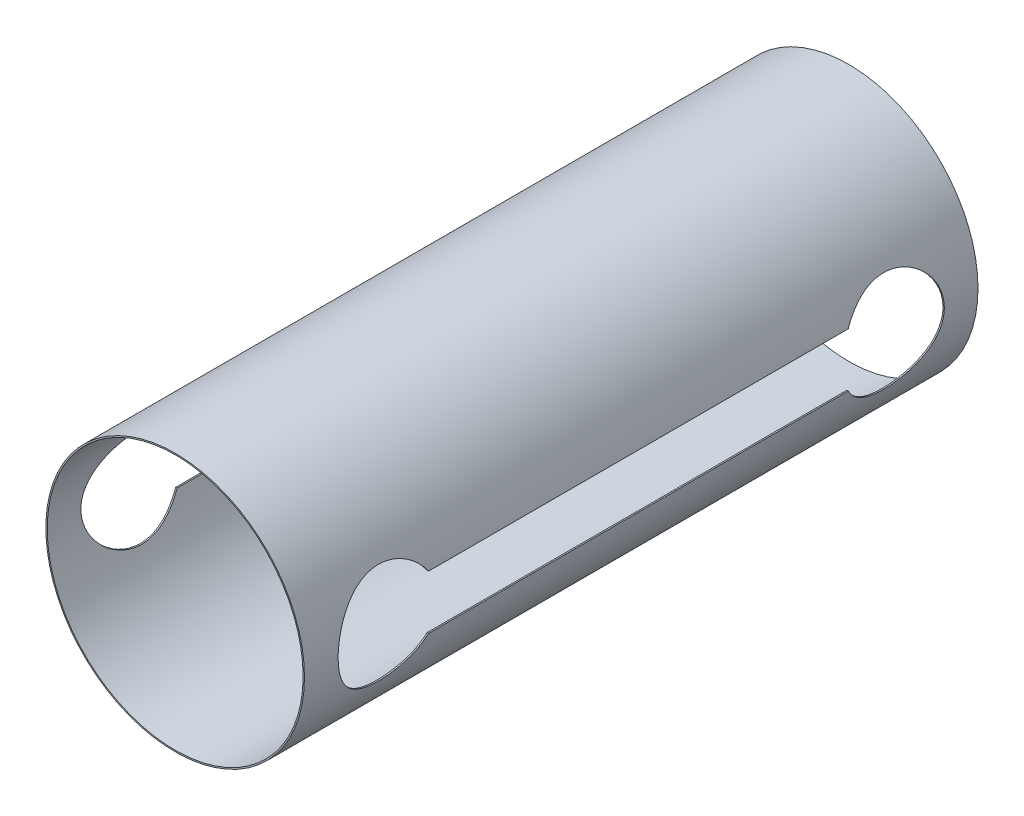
ISO-10303-21;
HEADER;
FILE_DESCRIPTION(('STEP AP214'),'2;1');
FILE_NAME('part.step','',(''),(''),'','','');
FILE_SCHEMA(('AUTOMOTIVE_DESIGN { 1 0 10303 214 1 1 1 1 }'));
ENDSEC;
DATA;
#1=APPLICATION_CONTEXT('core data for automotive mechanical design processes');
#2=APPLICATION_PROTOCOL_DEFINITION('international standard','automotive_design',2000,#1);
#3=PRODUCT_CONTEXT('',#1,'mechanical');
#4=PRODUCT('Part','Part','',(#3));
#5=PRODUCT_RELATED_PRODUCT_CATEGORY('part','',(#4));
#6=PRODUCT_DEFINITION_FORMATION('','',#4);
#7=PRODUCT_DEFINITION_CONTEXT('part definition',#1,'design');
#8=PRODUCT_DEFINITION('design','',#6,#7);
#9=PRODUCT_DEFINITION_SHAPE('','',#8);
#10=(LENGTH_UNIT() NAMED_UNIT(*) SI_UNIT(.MILLI.,.METRE.));
#11=(NAMED_UNIT(*) PLANE_ANGLE_UNIT() SI_UNIT($,.RADIAN.));
#12=(NAMED_UNIT(*) SI_UNIT($,.STERADIAN.) SOLID_ANGLE_UNIT());
#13=UNCERTAINTY_MEASURE_WITH_UNIT(LENGTH_MEASURE(1.E-05),#10,'distance_accuracy_value','');
#14=(GEOMETRIC_REPRESENTATION_CONTEXT(3) GLOBAL_UNCERTAINTY_ASSIGNED_CONTEXT((#13)) GLOBAL_UNIT_ASSIGNED_CONTEXT((#10,
#11,#12)) REPRESENTATION_CONTEXT('',''));
#15=CARTESIAN_POINT('',(0.,0.,0.));
#16=DIRECTION('',(0.,0.,1.));
#17=DIRECTION('',(1.,0.,0.));
#18=AXIS2_PLACEMENT_3D('',#15,#16,#17);
#19=CARTESIAN_POINT('',(0.,0.,-100.));
#20=DIRECTION('',(0.,0.,1.));
#21=DIRECTION('',(1.,0.,0.));
#22=AXIS2_PLACEMENT_3D('',#19,#20,#21);
#23=CYLINDRICAL_SURFACE('',#22,19.2);
#24=CARTESIAN_POINT('',(-18.7787113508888,-4.,-18.8442887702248));
#25=CARTESIAN_POINT('',(-18.7400915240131,-4.18137165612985,-18.7299489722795));
#26=CARTESIAN_POINT('',(-18.699803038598,-4.35755449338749,-18.6079870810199));
#27=CARTESIAN_POINT('',(-18.6170495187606,-4.69852165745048,-18.3497503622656));
#28=CARTESIAN_POINT('',(-18.5745847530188,-4.86330738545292,-18.2134772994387));
#29=CARTESIAN_POINT('',(-18.4885725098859,-5.18071441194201,-17.9273317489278));
#30=CARTESIAN_POINT('',(-18.4450236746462,-5.33331933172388,-17.7774415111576));
#31=CARTESIAN_POINT('',(-18.3581104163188,-5.6252079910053,-17.4651499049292));
#32=CARTESIAN_POINT('',(-18.3147459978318,-5.76449140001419,-17.3027482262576));
#33=CARTESIAN_POINT('',(-18.2294265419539,-6.0288734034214,-16.9663696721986));
#34=CARTESIAN_POINT('',(-18.1874718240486,-6.15396879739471,-16.7923901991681));
#35=CARTESIAN_POINT('',(-18.1062079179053,-6.38910940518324,-16.4338598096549));
#36=CARTESIAN_POINT('',(-18.0668996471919,-6.49914941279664,-16.2493052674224));
#37=CARTESIAN_POINT('',(-17.9921963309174,-6.70318360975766,-15.8709758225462));
#38=CARTESIAN_POINT('',(-17.9567979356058,-6.79719157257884,-15.6772090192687));
#39=CARTESIAN_POINT('',(-17.8910366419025,-6.96844521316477,-15.2815864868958));
#40=CARTESIAN_POINT('',(-17.8606733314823,-7.04569226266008,-15.0797314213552));
#41=CARTESIAN_POINT('',(-17.8066783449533,-7.18104408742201,-14.6742142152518));
#42=CARTESIAN_POINT('',(-17.7829043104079,-7.23955877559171,-14.4707080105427));
#43=CARTESIAN_POINT('',(-17.7419922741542,-7.33925196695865,-14.0589204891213));
#44=CARTESIAN_POINT('',(-17.7248514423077,-7.38043786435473,-13.8506412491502));
#45=CARTESIAN_POINT('',(-17.697816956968,-7.44503222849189,-13.4309013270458));
#46=CARTESIAN_POINT('',(-17.6879223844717,-7.46844294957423,-13.2194410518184));
#47=CARTESIAN_POINT('',(-17.6757490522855,-7.49720914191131,-12.7950822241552));
#48=CARTESIAN_POINT('',(-17.6734698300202,-7.50256570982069,-12.5821837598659));
#49=CARTESIAN_POINT('',(-17.6764962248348,-7.4954308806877,-12.1721857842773));
#50=CARTESIAN_POINT('',(-17.6812643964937,-7.48420418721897,-11.9750589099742));
#51=CARTESIAN_POINT('',(-17.6972692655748,-7.44627992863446,-11.582497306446));
#52=CARTESIAN_POINT('',(-17.7085081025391,-7.4195772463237,-11.3870631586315));
#53=CARTESIAN_POINT('',(-17.7370912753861,-7.35098417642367,-10.9994113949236));
#54=CARTESIAN_POINT('',(-17.7544334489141,-7.30909916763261,-10.8071926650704));
#55=CARTESIAN_POINT('',(-17.7946937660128,-7.21052735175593,-10.42711407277));
#56=CARTESIAN_POINT('',(-17.8176140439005,-7.15383487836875,-10.2392559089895));
#57=CARTESIAN_POINT('',(-17.8683309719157,-7.02619785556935,-9.86925437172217));
#58=CARTESIAN_POINT('',(-17.8961248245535,-6.95526147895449,-9.68710779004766));
#59=CARTESIAN_POINT('',(-17.9558219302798,-6.79966178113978,-9.32940776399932));
#60=CARTESIAN_POINT('',(-17.9877265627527,-6.71499384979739,-9.15385655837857));
#61=CARTESIAN_POINT('',(-18.054784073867,-6.53255033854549,-8.81033695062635));
#62=CARTESIAN_POINT('',(-18.0899372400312,-6.43477359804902,-8.64236922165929));
#63=CARTESIAN_POINT('',(-18.1625925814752,-6.22674611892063,-8.31487512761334));
#64=CARTESIAN_POINT('',(-18.2000948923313,-6.11649466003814,-8.15534925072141));
#65=CARTESIAN_POINT('',(-18.2792760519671,-5.87581837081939,-7.83439987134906));
#66=CARTESIAN_POINT('',(-18.3210614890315,-5.74451363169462,-7.67366170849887));
#67=CARTESIAN_POINT('',(-18.4051350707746,-5.46916044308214,-7.36373252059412));
#68=CARTESIAN_POINT('',(-18.4474230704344,-5.32511559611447,-7.21453825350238));
#69=CARTESIAN_POINT('',(-18.5314287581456,-5.02498186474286,-6.92841414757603));
#70=CARTESIAN_POINT('',(-18.5731460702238,-4.86888545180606,-6.79149209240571));
#71=CARTESIAN_POINT('',(-18.6548834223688,-4.54566818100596,-6.53091483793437));
#72=CARTESIAN_POINT('',(-18.6949040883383,-4.37855144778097,-6.40725472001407));
#73=CARTESIAN_POINT('',(-18.7736194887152,-4.0279805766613,-6.16977159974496));
#74=CARTESIAN_POINT('',(-18.8122145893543,-3.84415484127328,-6.05646314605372));
#75=CARTESIAN_POINT('',(-18.8853830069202,-3.46687350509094,-5.84587047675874));
#76=CARTESIAN_POINT('',(-18.9199579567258,-3.27342185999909,-5.74857974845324));
#77=CARTESIAN_POINT('',(-18.9841081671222,-2.87814471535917,-5.57084173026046));
#78=CARTESIAN_POINT('',(-19.013683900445,-2.67632000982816,-5.4903928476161));
#79=CARTESIAN_POINT('',(-19.0669658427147,-2.26575598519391,-5.34712555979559));
#80=CARTESIAN_POINT('',(-19.0906724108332,-2.05701709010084,-5.28430607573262));
#81=CARTESIAN_POINT('',(-19.1305367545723,-1.64423538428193,-5.17950337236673));
#82=CARTESIAN_POINT('',(-19.146997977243,-1.44043583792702,-5.1366767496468));
#83=CARTESIAN_POINT('',(-19.1734804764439,-1.02957045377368,-5.06808520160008));
#84=CARTESIAN_POINT('',(-19.1835019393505,-0.822504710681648,-5.04231978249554));
#85=CARTESIAN_POINT('',(-19.1968163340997,-0.40679152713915,-5.00813738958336));
#86=CARTESIAN_POINT('',(-19.2001112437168,-0.19814456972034,-4.9997153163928));
#87=CARTESIAN_POINT('',(-19.1998830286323,0.219117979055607,-5.00029934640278));
#88=CARTESIAN_POINT('',(-19.1963601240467,0.427733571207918,-5.00930488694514));
#89=CARTESIAN_POINT('',(-19.1829667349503,0.832183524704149,-5.04369770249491));
#90=CARTESIAN_POINT('',(-19.1734444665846,1.02810663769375,-5.06818655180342));
#91=CARTESIAN_POINT('',(-19.1486227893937,1.41712570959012,-5.1324608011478));
#92=CARTESIAN_POINT('',(-19.1333213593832,1.61022065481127,-5.17225155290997));
#93=CARTESIAN_POINT('',(-19.0973338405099,1.99214009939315,-5.26673896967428));
#94=CARTESIAN_POINT('',(-19.0766495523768,2.18096600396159,-5.32143065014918));
#95=CARTESIAN_POINT('',(-19.0303963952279,2.55327619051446,-5.44526506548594));
#96=CARTESIAN_POINT('',(-19.0048256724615,2.73675841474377,-5.51441328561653));
#97=CARTESIAN_POINT('',(-18.9489914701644,3.10000202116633,-5.66776355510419));
#98=CARTESIAN_POINT('',(-18.9186613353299,3.27966150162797,-5.75218252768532));
#99=CARTESIAN_POINT('',(-18.8543312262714,3.63127424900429,-5.934704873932));
#100=CARTESIAN_POINT('',(-18.8203300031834,3.80322486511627,-6.0328129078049));
#101=CARTESIAN_POINT('',(-18.7494719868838,4.13843607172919,-6.24201434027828));
#102=CARTESIAN_POINT('',(-18.7126149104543,4.30169579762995,-6.35310902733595));
#103=CARTESIAN_POINT('',(-18.6369121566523,4.618664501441,-6.58757208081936));
#104=CARTESIAN_POINT('',(-18.5980663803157,4.77237300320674,-6.71094105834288));
#105=CARTESIAN_POINT('',(-18.5167986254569,5.07886499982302,-6.97741605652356));
#106=CARTESIAN_POINT('',(-18.4743059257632,5.23097402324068,-7.12127711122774));
#107=CARTESIAN_POINT('',(-18.3892397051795,5.52258369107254,-7.42114207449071));
#108=CARTESIAN_POINT('',(-18.3466662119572,5.6620880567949,-7.57714237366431));
#109=CARTESIAN_POINT('',(-18.2625494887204,5.92779226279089,-7.90053258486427));
#110=CARTESIAN_POINT('',(-18.2210069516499,6.05398333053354,-8.06792988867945));
#111=CARTESIAN_POINT('',(-18.1401607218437,6.29208832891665,-8.41300240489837));
#112=CARTESIAN_POINT('',(-18.1008561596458,6.40400782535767,-8.5906735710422));
#113=CARTESIAN_POINT('',(-18.0246648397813,6.6154676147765,-8.9599447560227));
#114=CARTESIAN_POINT('',(-17.9878644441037,6.71462293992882,-9.15178348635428));
#115=CARTESIAN_POINT('',(-17.9190158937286,6.89625302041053,-9.54392784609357));
#116=CARTESIAN_POINT('',(-17.886965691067,6.97873496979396,-9.74422977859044));
#117=CARTESIAN_POINT('',(-17.8287062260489,7.12625632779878,-10.1519265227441));
#118=CARTESIAN_POINT('',(-17.8024953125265,7.19130066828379,-10.3593193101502));
#119=CARTESIAN_POINT('',(-17.7568553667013,7.30327001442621,-10.7796677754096));
#120=CARTESIAN_POINT('',(-17.7374258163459,7.35019640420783,-10.9926230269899));
#121=CARTESIAN_POINT('',(-17.7070197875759,7.42313369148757,-11.4095149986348));
#122=CARTESIAN_POINT('',(-17.6956079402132,7.45022591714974,-11.61323121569));
#123=CARTESIAN_POINT('',(-17.6798257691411,7.48760156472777,-12.0224703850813));
#124=CARTESIAN_POINT('',(-17.6754551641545,7.49788565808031,-12.2279932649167));
#125=CARTESIAN_POINT('',(-17.6739104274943,7.50152607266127,-12.6391619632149));
#126=CARTESIAN_POINT('',(-17.6767344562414,7.49488672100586,-12.8448077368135));
#127=CARTESIAN_POINT('',(-17.6894750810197,7.46476644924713,-13.2546362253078));
#128=CARTESIAN_POINT('',(-17.6993915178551,7.44128590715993,-13.4588189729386));
#129=CARTESIAN_POINT('',(-17.7252682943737,7.37942532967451,-13.8534600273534));
#130=CARTESIAN_POINT('',(-17.7408830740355,7.34189449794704,-14.0440750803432));
#131=CARTESIAN_POINT('',(-17.777694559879,7.25230444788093,-14.421376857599));
#132=CARTESIAN_POINT('',(-17.7988932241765,7.20024013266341,-14.6080621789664));
#133=CARTESIAN_POINT('',(-17.8462467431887,7.08205648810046,-14.9762592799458));
#134=CARTESIAN_POINT('',(-17.8724012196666,7.01593823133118,-15.1577714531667));
#135=CARTESIAN_POINT('',(-17.92894604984,6.87015314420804,-15.5146589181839));
#136=CARTESIAN_POINT('',(-17.9593379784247,6.79048127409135,-15.6900318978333));
#137=CARTESIAN_POINT('',(-18.0248419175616,6.61469722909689,-16.0405884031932));
#138=CARTESIAN_POINT('',(-18.060095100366,6.51805052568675,-16.2154774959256));
#139=CARTESIAN_POINT('',(-18.1333557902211,6.31137318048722,-16.5566449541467));
#140=CARTESIAN_POINT('',(-18.1713644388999,6.20133697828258,-16.7229197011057));
#141=CARTESIAN_POINT('',(-18.2491100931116,5.96866856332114,-17.0458296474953));
#142=CARTESIAN_POINT('',(-18.2888460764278,5.84604374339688,-17.202470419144));
#143=CARTESIAN_POINT('',(-18.3690761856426,5.5888473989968,-17.5054266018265));
#144=CARTESIAN_POINT('',(-18.4095704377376,5.45427387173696,-17.6517402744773));
#145=CARTESIAN_POINT('',(-18.507031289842,5.1158763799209,-17.9915030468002));
#146=CARTESIAN_POINT('',(-18.5638865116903,4.90642431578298,-18.1794303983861));
#147=CARTESIAN_POINT('',(-18.6743664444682,4.46760980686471,-18.5307140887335));
#148=CARTESIAN_POINT('',(-18.7279958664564,4.23827765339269,-18.6941068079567));
#149=CARTESIAN_POINT('',(-18.7787113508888,4.,-18.8442887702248));
#150=B_SPLINE_CURVE_WITH_KNOTS('',3,(#24,#25,#26,#27,#28,#29,#30,#31,#32,#33,#34,#35,#36,#37,
#38,#39,#40,#41,#42,#43,#44,#45,#46,#47,#48,#49,#50,#51,#52,#53,#54,#55,#56,#57,#58,#59,#60,#61,
#62,#63,#64,#65,#66,#67,#68,#69,#70,#71,#72,#73,#74,#75,#76,#77,#78,#79,#80,#81,#82,#83,#84,#85,
#86,#87,#88,#89,#90,#91,#92,#93,#94,#95,#96,#97,#98,#99,#100,#101,#102,#103,#104,#105,#106,#107,
#108,#109,#110,#111,#112,#113,#114,#115,#116,#117,#118,#119,#120,#121,#122,#123,#124,#125,#126,
#127,#128,#129,#130,#131,#132,#133,#134,#135,#136,#137,#138,#139,#140,#141,#142,#143,#144,#145,
#146,#147,#148,#149),.UNSPECIFIED.,.F.,.F.,(4,2,2,2,2,2,2,2,2,2,2,2,2,2,2,2,2,2,2,2,2,2,2,2,2,2,
2,2,2,2,2,2,2,2,2,2,2,2,2,2,2,2,2,2,2,2,2,2,2,2,2,2,2,2,2,2,2,2,2,2,2,2,4),(0.,
0.653331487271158,1.30658250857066,1.96069761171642,2.61482893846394,3.26910752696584,
3.92361179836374,4.57755090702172,5.23143647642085,5.86984058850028,6.50797201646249,
7.14602249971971,7.78403422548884,8.37583189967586,8.96782536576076,9.55960930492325,
10.1516200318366,10.7432920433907,11.3351631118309,11.9270866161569,12.51904431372,
13.1534818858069,13.7877406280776,14.4223988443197,15.0568208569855,15.7140871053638,
16.3710854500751,17.0280216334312,17.6849176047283,18.310813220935,18.9366907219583,
19.5623841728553,20.1880574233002,20.7803932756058,21.3729364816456,21.9652817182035,
22.5578521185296,23.1596166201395,23.7615864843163,24.3636161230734,24.9656757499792,
25.605846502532,26.2458276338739,26.8862278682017,27.5263775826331,28.1827278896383,
28.8387943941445,29.4946751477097,30.1505057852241,30.7671866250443,31.3838428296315,
32.0003413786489,32.6168260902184,33.2008650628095,33.7851091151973,34.3693085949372,
34.9537257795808,35.5617754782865,36.1700785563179,36.7780264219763,37.3860763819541,
38.2455155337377,39.1036674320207),.UNSPECIFIED.);
#151=CARTESIAN_POINT('',(-18.7787113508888,-4.,-18.8442887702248));
#152=VERTEX_POINT('',#151);
#153=CARTESIAN_POINT('',(-18.7787113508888,4.,-18.8442887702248));
#154=VERTEX_POINT('',#153);
#155=EDGE_CURVE('E59',#152,#154,#150,.T.);
#156=ORIENTED_EDGE('',*,*,#155,.F.);
#157=DIRECTION('',(0.,0.,1.));
#158=VECTOR('',#157,1.);
#159=CARTESIAN_POINT('',(-18.7787113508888,-4.,-100.));
#160=LINE('',#159,#158);
#161=CARTESIAN_POINT('',(-18.7787113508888,-4.,-81.1557112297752));
#162=VERTEX_POINT('',#161);
#163=EDGE_CURVE('E170',#162,#152,#160,.T.);
#164=ORIENTED_EDGE('',*,*,#163,.F.);
#165=CARTESIAN_POINT('',(-18.7787113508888,4.,-81.1557112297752));
#166=CARTESIAN_POINT('',(-18.7400915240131,4.18137165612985,-81.2700510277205));
#167=CARTESIAN_POINT('',(-18.699803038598,4.35755449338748,-81.3920129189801));
#168=CARTESIAN_POINT('',(-18.6170495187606,4.69852165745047,-81.6502496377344));
#169=CARTESIAN_POINT('',(-18.5745847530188,4.86330738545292,-81.7865227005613));
#170=CARTESIAN_POINT('',(-18.4885725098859,5.180714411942,-82.0726682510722));
#171=CARTESIAN_POINT('',(-18.4450236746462,5.33331933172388,-82.2225584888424));
#172=CARTESIAN_POINT('',(-18.3581104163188,5.6252079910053,-82.5348500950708));
#173=CARTESIAN_POINT('',(-18.3147459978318,5.76449140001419,-82.6972517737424));
#174=CARTESIAN_POINT('',(-18.2294265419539,6.0288734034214,-83.0336303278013));
#175=CARTESIAN_POINT('',(-18.1874718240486,6.1539687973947,-83.2076098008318));
#176=CARTESIAN_POINT('',(-18.1062079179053,6.38910940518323,-83.5661401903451));
#177=CARTESIAN_POINT('',(-18.0668996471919,6.49914941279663,-83.7506947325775));
#178=CARTESIAN_POINT('',(-17.9921963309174,6.70318360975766,-84.1290241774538));
#179=CARTESIAN_POINT('',(-17.9567979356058,6.79719157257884,-84.3227909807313));
#180=CARTESIAN_POINT('',(-17.8910366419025,6.96844521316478,-84.7184135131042));
#181=CARTESIAN_POINT('',(-17.8606733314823,7.04569226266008,-84.9202685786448));
#182=CARTESIAN_POINT('',(-17.8066783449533,7.18104408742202,-85.3257857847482));
#183=CARTESIAN_POINT('',(-17.7829043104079,7.23955877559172,-85.5292919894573));
#184=CARTESIAN_POINT('',(-17.7419922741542,7.33925196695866,-85.9410795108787));
#185=CARTESIAN_POINT('',(-17.7248514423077,7.38043786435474,-86.1493587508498));
#186=CARTESIAN_POINT('',(-17.697816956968,7.44503222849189,-86.5690986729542));
#187=CARTESIAN_POINT('',(-17.6879223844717,7.46844294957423,-86.7805589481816));
#188=CARTESIAN_POINT('',(-17.6757490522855,7.49720914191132,-87.2049177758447));
#189=CARTESIAN_POINT('',(-17.6734698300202,7.5025657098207,-87.4178162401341));
#190=CARTESIAN_POINT('',(-17.6764962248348,7.49543088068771,-87.8278142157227));
#191=CARTESIAN_POINT('',(-17.6812643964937,7.48420418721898,-88.0249410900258));
#192=CARTESIAN_POINT('',(-17.6972692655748,7.44627992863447,-88.417502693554));
#193=CARTESIAN_POINT('',(-17.7085081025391,7.4195772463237,-88.6129368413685));
#194=CARTESIAN_POINT('',(-17.7370912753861,7.35098417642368,-89.0005886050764));
#195=CARTESIAN_POINT('',(-17.7544334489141,7.30909916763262,-89.1928073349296));
#196=CARTESIAN_POINT('',(-17.7946937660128,7.21052735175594,-89.57288592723));
#197=CARTESIAN_POINT('',(-17.8176140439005,7.15383487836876,-89.7607440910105));
#198=CARTESIAN_POINT('',(-17.8683309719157,7.02619785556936,-90.1307456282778));
#199=CARTESIAN_POINT('',(-17.8961248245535,6.9552614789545,-90.3128922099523));
#200=CARTESIAN_POINT('',(-17.9558219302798,6.79966178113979,-90.6705922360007));
#201=CARTESIAN_POINT('',(-17.9877265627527,6.7149938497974,-90.8461434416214));
#202=CARTESIAN_POINT('',(-18.054784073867,6.5325503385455,-91.1896630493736));
#203=CARTESIAN_POINT('',(-18.0899372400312,6.43477359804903,-91.3576307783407));
#204=CARTESIAN_POINT('',(-18.1625925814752,6.22674611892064,-91.6851248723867));
#205=CARTESIAN_POINT('',(-18.2000948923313,6.11649466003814,-91.8446507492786));
#206=CARTESIAN_POINT('',(-18.2792760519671,5.8758183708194,-92.165600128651));
#207=CARTESIAN_POINT('',(-18.3210614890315,5.74451363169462,-92.3263382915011));
#208=CARTESIAN_POINT('',(-18.4051350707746,5.46916044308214,-92.6362674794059));
#209=CARTESIAN_POINT('',(-18.4474230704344,5.32511559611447,-92.7854617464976));
#210=CARTESIAN_POINT('',(-18.5314287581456,5.02498186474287,-93.071585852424));
#211=CARTESIAN_POINT('',(-18.5731460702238,4.86888545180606,-93.2085079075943));
#212=CARTESIAN_POINT('',(-18.6548834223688,4.54566818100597,-93.4690851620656));
#213=CARTESIAN_POINT('',(-18.6949040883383,4.37855144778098,-93.5927452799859));
#214=CARTESIAN_POINT('',(-18.7736194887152,4.02798057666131,-93.830228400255));
#215=CARTESIAN_POINT('',(-18.8122145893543,3.84415484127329,-93.9435368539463));
#216=CARTESIAN_POINT('',(-18.8853830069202,3.46687350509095,-94.1541295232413));
#217=CARTESIAN_POINT('',(-18.9199579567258,3.27342185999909,-94.2514202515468));
#218=CARTESIAN_POINT('',(-18.9841081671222,2.87814471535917,-94.4291582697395));
#219=CARTESIAN_POINT('',(-19.013683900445,2.67632000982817,-94.5096071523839));
#220=CARTESIAN_POINT('',(-19.0669658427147,2.26575598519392,-94.6528744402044));
#221=CARTESIAN_POINT('',(-19.0906724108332,2.05701709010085,-94.7156939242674));
#222=CARTESIAN_POINT('',(-19.1305367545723,1.64423538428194,-94.8204966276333));
#223=CARTESIAN_POINT('',(-19.146997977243,1.44043583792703,-94.8633232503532));
#224=CARTESIAN_POINT('',(-19.1734804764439,1.02957045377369,-94.9319147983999));
#225=CARTESIAN_POINT('',(-19.1835019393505,0.822504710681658,-94.9576802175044));
#226=CARTESIAN_POINT('',(-19.1968163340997,0.40679152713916,-94.9918626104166));
#227=CARTESIAN_POINT('',(-19.2001112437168,0.19814456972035,-95.0002846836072));
#228=CARTESIAN_POINT('',(-19.1998830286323,-0.219117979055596,-94.9997006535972));
#229=CARTESIAN_POINT('',(-19.1963601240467,-0.427733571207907,-94.9906951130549));
#230=CARTESIAN_POINT('',(-19.1829667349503,-0.832183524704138,-94.9563022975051));
#231=CARTESIAN_POINT('',(-19.1734444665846,-1.02810663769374,-94.9318134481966));
#232=CARTESIAN_POINT('',(-19.1486227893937,-1.4171257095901,-94.8675391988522));
#233=CARTESIAN_POINT('',(-19.1333213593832,-1.61022065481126,-94.82774844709));
#234=CARTESIAN_POINT('',(-19.0973338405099,-1.99214009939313,-94.7332610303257));
#235=CARTESIAN_POINT('',(-19.0766495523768,-2.18096600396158,-94.6785693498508));
#236=CARTESIAN_POINT('',(-19.0303963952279,-2.55327619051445,-94.5547349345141));
#237=CARTESIAN_POINT('',(-19.0048256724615,-2.73675841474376,-94.4855867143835));
#238=CARTESIAN_POINT('',(-18.9489914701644,-3.10000202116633,-94.3322364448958));
#239=CARTESIAN_POINT('',(-18.9186613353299,-3.27966150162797,-94.2478174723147));
#240=CARTESIAN_POINT('',(-18.8543312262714,-3.63127424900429,-94.065295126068));
#241=CARTESIAN_POINT('',(-18.8203300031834,-3.80322486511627,-93.9671870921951));
#242=CARTESIAN_POINT('',(-18.7494719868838,-4.13843607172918,-93.7579856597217));
#243=CARTESIAN_POINT('',(-18.7126149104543,-4.30169579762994,-93.646890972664));
#244=CARTESIAN_POINT('',(-18.6369121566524,-4.61866450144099,-93.4124279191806));
#245=CARTESIAN_POINT('',(-18.5980663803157,-4.77237300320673,-93.2890589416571));
#246=CARTESIAN_POINT('',(-18.5167986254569,-5.07886499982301,-93.0225839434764));
#247=CARTESIAN_POINT('',(-18.4743059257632,-5.23097402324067,-92.8787228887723));
#248=CARTESIAN_POINT('',(-18.3892397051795,-5.52258369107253,-92.5788579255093));
#249=CARTESIAN_POINT('',(-18.3466662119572,-5.66208805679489,-92.4228576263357));
#250=CARTESIAN_POINT('',(-18.2625494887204,-5.92779226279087,-92.0994674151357));
#251=CARTESIAN_POINT('',(-18.2210069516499,-6.05398333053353,-91.9320701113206));
#252=CARTESIAN_POINT('',(-18.1401607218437,-6.29208832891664,-91.5869975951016));
#253=CARTESIAN_POINT('',(-18.1008561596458,-6.40400782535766,-91.4093264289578));
#254=CARTESIAN_POINT('',(-18.0246648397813,-6.61546761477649,-91.0400552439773));
#255=CARTESIAN_POINT('',(-17.9878644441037,-6.71462293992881,-90.8482165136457));
#256=CARTESIAN_POINT('',(-17.9190158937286,-6.89625302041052,-90.4560721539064));
#257=CARTESIAN_POINT('',(-17.886965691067,-6.97873496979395,-90.2557702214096));
#258=CARTESIAN_POINT('',(-17.8287062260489,-7.12625632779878,-89.8480734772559));
#259=CARTESIAN_POINT('',(-17.8024953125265,-7.19130066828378,-89.6406806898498));
#260=CARTESIAN_POINT('',(-17.7568553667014,-7.3032700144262,-89.2203322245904));
#261=CARTESIAN_POINT('',(-17.7374258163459,-7.35019640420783,-89.0073769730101));
#262=CARTESIAN_POINT('',(-17.7070197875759,-7.42313369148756,-88.5904850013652));
#263=CARTESIAN_POINT('',(-17.6956079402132,-7.45022591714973,-88.38676878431));
#264=CARTESIAN_POINT('',(-17.6798257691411,-7.48760156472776,-87.9775296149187));
#265=CARTESIAN_POINT('',(-17.6754551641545,-7.49788565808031,-87.7720067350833));
#266=CARTESIAN_POINT('',(-17.6739104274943,-7.50152607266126,-87.3608380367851));
#267=CARTESIAN_POINT('',(-17.6767344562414,-7.49488672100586,-87.1551922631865));
#268=CARTESIAN_POINT('',(-17.6894750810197,-7.46476644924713,-86.7453637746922));
#269=CARTESIAN_POINT('',(-17.6993915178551,-7.44128590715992,-86.5411810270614));
#270=CARTESIAN_POINT('',(-17.7252682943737,-7.37942532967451,-86.1465399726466));
#271=CARTESIAN_POINT('',(-17.7408830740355,-7.34189449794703,-85.9559249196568));
#272=CARTESIAN_POINT('',(-17.777694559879,-7.25230444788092,-85.578623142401));
#273=CARTESIAN_POINT('',(-17.7988932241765,-7.20024013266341,-85.3919378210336));
#274=CARTESIAN_POINT('',(-17.8462467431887,-7.08205648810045,-85.0237407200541));
#275=CARTESIAN_POINT('',(-17.8724012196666,-7.01593823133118,-84.8422285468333));
#276=CARTESIAN_POINT('',(-17.92894604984,-6.87015314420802,-84.4853410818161));
#277=CARTESIAN_POINT('',(-17.9593379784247,-6.79048127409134,-84.3099681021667));
#278=CARTESIAN_POINT('',(-18.0248419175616,-6.61469722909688,-83.9594115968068));
#279=CARTESIAN_POINT('',(-18.060095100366,-6.51805052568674,-83.7845225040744));
#280=CARTESIAN_POINT('',(-18.1333557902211,-6.31137318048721,-83.4433550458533));
#281=CARTESIAN_POINT('',(-18.1713644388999,-6.20133697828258,-83.2770802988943));
#282=CARTESIAN_POINT('',(-18.2491100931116,-5.96866856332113,-82.9541703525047));
#283=CARTESIAN_POINT('',(-18.2888460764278,-5.84604374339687,-82.797529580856));
#284=CARTESIAN_POINT('',(-18.3690761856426,-5.58884739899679,-82.4945733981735));
#285=CARTESIAN_POINT('',(-18.4095704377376,-5.45427387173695,-82.3482597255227));
#286=CARTESIAN_POINT('',(-18.507031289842,-5.11587637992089,-82.0084969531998));
#287=CARTESIAN_POINT('',(-18.5638865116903,-4.90642431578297,-81.8205696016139));
#288=CARTESIAN_POINT('',(-18.6743664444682,-4.4676098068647,-81.4692859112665));
#289=CARTESIAN_POINT('',(-18.7279958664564,-4.23827765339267,-81.3058931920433));
#290=CARTESIAN_POINT('',(-18.7787113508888,-4.,-81.1557112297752));
#291=B_SPLINE_CURVE_WITH_KNOTS('',3,(#165,#166,#167,#168,#169,#170,#171,#172,#173,#174,#175,
#176,#177,#178,#179,#180,#181,#182,#183,#184,#185,#186,#187,#188,#189,#190,#191,#192,#193,#194,
#195,#196,#197,#198,#199,#200,#201,#202,#203,#204,#205,#206,#207,#208,#209,#210,#211,#212,#213,
#214,#215,#216,#217,#218,#219,#220,#221,#222,#223,#224,#225,#226,#227,#228,#229,#230,#231,#232,
#233,#234,#235,#236,#237,#238,#239,#240,#241,#242,#243,#244,#245,#246,#247,#248,#249,#250,#251,
#252,#253,#254,#255,#256,#257,#258,#259,#260,#261,#262,#263,#264,#265,#266,#267,#268,#269,#270,
#271,#272,#273,#274,#275,#276,#277,#278,#279,#280,#281,#282,#283,#284,#285,#286,#287,#288,#289,
#290),.UNSPECIFIED.,.F.,.F.,(4,2,2,2,2,2,2,2,2,2,2,2,2,2,2,2,2,2,2,2,2,2,2,2,2,2,2,2,2,2,2,2,2,
2,2,2,2,2,2,2,2,2,2,2,2,2,2,2,2,2,2,2,2,2,2,2,2,2,2,2,2,2,4),(0.,0.653331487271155,
1.30658250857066,1.96069761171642,2.61482893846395,3.26910752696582,3.92361179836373,
4.57755090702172,5.23143647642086,5.8698405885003,6.50797201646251,7.14602249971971,
7.78403422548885,8.37583189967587,8.96782536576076,9.55960930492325,10.1516200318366,
10.7432920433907,11.3351631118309,11.9270866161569,12.51904431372,13.1534818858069,
13.7877406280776,14.4223988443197,15.0568208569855,15.7140871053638,16.3710854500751,
17.0280216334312,17.6849176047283,18.310813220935,18.9366907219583,19.5623841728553,
20.1880574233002,20.7803932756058,21.3729364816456,21.9652817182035,22.5578521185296,
23.1596166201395,23.7615864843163,24.3636161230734,24.9656757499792,25.605846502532,
26.2458276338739,26.8862278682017,27.5263775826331,28.1827278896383,28.8387943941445,
29.4946751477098,30.1505057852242,30.7671866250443,31.3838428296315,32.000341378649,
32.6168260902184,33.2008650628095,33.7851091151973,34.3693085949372,34.9537257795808,
35.5617754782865,36.1700785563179,36.7780264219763,37.3860763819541,38.2455155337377,
39.1036674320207),.UNSPECIFIED.);
#292=CARTESIAN_POINT('',(-18.7787113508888,4.,-81.1557112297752));
#293=VERTEX_POINT('',#292);
#294=EDGE_CURVE('E178',#293,#162,#291,.T.);
#295=ORIENTED_EDGE('',*,*,#294,.F.);
#296=DIRECTION('',(0.,0.,1.));
#297=VECTOR('',#296,1.);
#298=CARTESIAN_POINT('',(-18.7787113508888,4.,-100.));
#299=LINE('',#298,#297);
#300=EDGE_CURVE('E164',#154,#293,#299,.F.);
#301=ORIENTED_EDGE('',*,*,#300,.F.);
#302=EDGE_LOOP('',(#156,#164,#295,#301));
#303=FACE_BOUND('',#302,.T.);
#304=CARTESIAN_POINT('',(18.7787113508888,3.99999999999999,-18.8442887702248));
#305=CARTESIAN_POINT('',(18.7400915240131,4.18137165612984,-18.7299489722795));
#306=CARTESIAN_POINT('',(18.6998030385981,4.35755449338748,-18.6079870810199));
#307=CARTESIAN_POINT('',(18.6170495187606,4.69852165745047,-18.3497503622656));
#308=CARTESIAN_POINT('',(18.5745847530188,4.86330738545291,-18.2134772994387));
#309=CARTESIAN_POINT('',(18.4885725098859,5.180714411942,-17.9273317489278));
#310=CARTESIAN_POINT('',(18.4450236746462,5.33331933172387,-17.7774415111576));
#311=CARTESIAN_POINT('',(18.3581104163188,5.62520799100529,-17.4651499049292));
#312=CARTESIAN_POINT('',(18.3147459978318,5.76449140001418,-17.3027482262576));
#313=CARTESIAN_POINT('',(18.2294265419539,6.02887340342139,-16.9663696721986));
#314=CARTESIAN_POINT('',(18.1874718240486,6.1539687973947,-16.7923901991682));
#315=CARTESIAN_POINT('',(18.1062079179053,6.38910940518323,-16.4338598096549));
#316=CARTESIAN_POINT('',(18.0668996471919,6.49914941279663,-16.2493052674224));
#317=CARTESIAN_POINT('',(17.9921963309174,6.70318360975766,-15.8709758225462));
#318=CARTESIAN_POINT('',(17.9567979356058,6.79719157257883,-15.6772090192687));
#319=CARTESIAN_POINT('',(17.8910366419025,6.96844521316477,-15.2815864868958));
#320=CARTESIAN_POINT('',(17.8606733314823,7.04569226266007,-15.0797314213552));
#321=CARTESIAN_POINT('',(17.8066783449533,7.18104408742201,-14.6742142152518));
#322=CARTESIAN_POINT('',(17.7829043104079,7.2395587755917,-14.4707080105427));
#323=CARTESIAN_POINT('',(17.7419922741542,7.33925196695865,-14.0589204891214));
#324=CARTESIAN_POINT('',(17.7248514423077,7.38043786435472,-13.8506412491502));
#325=CARTESIAN_POINT('',(17.697816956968,7.44503222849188,-13.4309013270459));
#326=CARTESIAN_POINT('',(17.6879223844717,7.46844294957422,-13.2194410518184));
#327=CARTESIAN_POINT('',(17.6757490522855,7.49720914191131,-12.7950822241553));
#328=CARTESIAN_POINT('',(17.6734698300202,7.50256570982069,-12.5821837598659));
#329=CARTESIAN_POINT('',(17.6764962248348,7.4954308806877,-12.1721857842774));
#330=CARTESIAN_POINT('',(17.6812643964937,7.48420418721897,-11.9750589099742));
#331=CARTESIAN_POINT('',(17.6972692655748,7.44627992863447,-11.582497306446));
#332=CARTESIAN_POINT('',(17.7085081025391,7.4195772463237,-11.3870631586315));
#333=CARTESIAN_POINT('',(17.7370912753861,7.35098417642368,-10.9994113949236));
#334=CARTESIAN_POINT('',(17.7544334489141,7.30909916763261,-10.8071926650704));
#335=CARTESIAN_POINT('',(17.7946937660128,7.21052735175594,-10.42711407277));
#336=CARTESIAN_POINT('',(17.8176140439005,7.15383487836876,-10.2392559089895));
#337=CARTESIAN_POINT('',(17.8683309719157,7.02619785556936,-9.86925437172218));
#338=CARTESIAN_POINT('',(17.8961248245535,6.9552614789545,-9.68710779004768));
#339=CARTESIAN_POINT('',(17.9558219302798,6.79966178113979,-9.32940776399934));
#340=CARTESIAN_POINT('',(17.9877265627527,6.7149938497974,-9.15385655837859));
#341=CARTESIAN_POINT('',(18.054784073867,6.5325503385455,-8.81033695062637));
#342=CARTESIAN_POINT('',(18.0899372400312,6.43477359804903,-8.6423692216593));
#343=CARTESIAN_POINT('',(18.1625925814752,6.22674611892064,-8.31487512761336));
#344=CARTESIAN_POINT('',(18.2000948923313,6.11649466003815,-8.15534925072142));
#345=CARTESIAN_POINT('',(18.2792760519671,5.8758183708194,-7.83439987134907));
#346=CARTESIAN_POINT('',(18.3210614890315,5.74451363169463,-7.67366170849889));
#347=CARTESIAN_POINT('',(18.4051350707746,5.46916044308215,-7.36373252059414));
#348=CARTESIAN_POINT('',(18.4474230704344,5.32511559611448,-7.21453825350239));
#349=CARTESIAN_POINT('',(18.5314287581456,5.02498186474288,-6.92841414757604));
#350=CARTESIAN_POINT('',(18.5731460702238,4.86888545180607,-6.79149209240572));
#351=CARTESIAN_POINT('',(18.6548834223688,4.54566818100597,-6.53091483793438));
#352=CARTESIAN_POINT('',(18.6949040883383,4.37855144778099,-6.40725472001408));
#353=CARTESIAN_POINT('',(18.7736194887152,4.02798057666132,-6.16977159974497));
#354=CARTESIAN_POINT('',(18.8122145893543,3.8441548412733,-6.05646314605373));
#355=CARTESIAN_POINT('',(18.8853830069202,3.46687350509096,-5.84587047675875));
#356=CARTESIAN_POINT('',(18.9199579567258,3.2734218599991,-5.74857974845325));
#357=CARTESIAN_POINT('',(18.9841081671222,2.87814471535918,-5.57084173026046));
#358=CARTESIAN_POINT('',(19.013683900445,2.67632000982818,-5.49039284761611));
#359=CARTESIAN_POINT('',(19.0669658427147,2.26575598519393,-5.34712555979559));
#360=CARTESIAN_POINT('',(19.0906724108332,2.05701709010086,-5.28430607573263));
#361=CARTESIAN_POINT('',(19.1305367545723,1.64423538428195,-5.17950337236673));
#362=CARTESIAN_POINT('',(19.146997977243,1.44043583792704,-5.13667674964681));
#363=CARTESIAN_POINT('',(19.1734804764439,1.0295704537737,-5.06808520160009));
#364=CARTESIAN_POINT('',(19.1835019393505,0.822504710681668,-5.04231978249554));
#365=CARTESIAN_POINT('',(19.1968163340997,0.40679152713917,-5.00813738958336));
#366=CARTESIAN_POINT('',(19.2001112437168,0.198144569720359,-4.9997153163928));
#367=CARTESIAN_POINT('',(19.1998830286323,-0.219117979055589,-5.00029934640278));
#368=CARTESIAN_POINT('',(19.1963601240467,-0.4277335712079,-5.00930488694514));
#369=CARTESIAN_POINT('',(19.1829667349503,-0.832183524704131,-5.04369770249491));
#370=CARTESIAN_POINT('',(19.1734444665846,-1.02810663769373,-5.06818655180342));
#371=CARTESIAN_POINT('',(19.1486227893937,-1.4171257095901,-5.1324608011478));
#372=CARTESIAN_POINT('',(19.1333213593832,-1.61022065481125,-5.17225155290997));
#373=CARTESIAN_POINT('',(19.0973338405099,-1.99214009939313,-5.26673896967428));
#374=CARTESIAN_POINT('',(19.0766495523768,-2.18096600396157,-5.32143065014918));
#375=CARTESIAN_POINT('',(19.0303963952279,-2.55327619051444,-5.44526506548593));
#376=CARTESIAN_POINT('',(19.0048256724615,-2.73675841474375,-5.51441328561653));
#377=CARTESIAN_POINT('',(18.9489914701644,-3.10000202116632,-5.66776355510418));
#378=CARTESIAN_POINT('',(18.9186613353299,-3.27966150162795,-5.75218252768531));
#379=CARTESIAN_POINT('',(18.8543312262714,-3.63127424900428,-5.93470487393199));
#380=CARTESIAN_POINT('',(18.8203300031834,-3.80322486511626,-6.03281290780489));
#381=CARTESIAN_POINT('',(18.7494719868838,-4.13843607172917,-6.24201434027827));
#382=CARTESIAN_POINT('',(18.7126149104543,-4.30169579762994,-6.35310902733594));
#383=CARTESIAN_POINT('',(18.6369121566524,-4.61866450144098,-6.58757208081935));
#384=CARTESIAN_POINT('',(18.5980663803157,-4.77237300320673,-6.71094105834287));
#385=CARTESIAN_POINT('',(18.5167986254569,-5.07886499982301,-6.97741605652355));
#386=CARTESIAN_POINT('',(18.4743059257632,-5.23097402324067,-7.12127711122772));
#387=CARTESIAN_POINT('',(18.3892397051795,-5.52258369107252,-7.4211420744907));
#388=CARTESIAN_POINT('',(18.3466662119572,-5.66208805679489,-7.5771423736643));
#389=CARTESIAN_POINT('',(18.2625494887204,-5.92779226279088,-7.90053258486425));
#390=CARTESIAN_POINT('',(18.2210069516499,-6.05398333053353,-8.06792988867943));
#391=CARTESIAN_POINT('',(18.1401607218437,-6.29208832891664,-8.41300240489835));
#392=CARTESIAN_POINT('',(18.1008561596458,-6.40400782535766,-8.59067357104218));
#393=CARTESIAN_POINT('',(18.0246648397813,-6.61546761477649,-8.95994475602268));
#394=CARTESIAN_POINT('',(17.9878644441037,-6.71462293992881,-9.15178348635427));
#395=CARTESIAN_POINT('',(17.9190158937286,-6.89625302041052,-9.54392784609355));
#396=CARTESIAN_POINT('',(17.886965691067,-6.97873496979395,-9.74422977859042));
#397=CARTESIAN_POINT('',(17.8287062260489,-7.12625632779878,-10.1519265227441));
#398=CARTESIAN_POINT('',(17.8024953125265,-7.19130066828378,-10.3593193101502));
#399=CARTESIAN_POINT('',(17.7568553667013,-7.30327001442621,-10.7796677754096));
#400=CARTESIAN_POINT('',(17.7374258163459,-7.35019640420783,-10.9926230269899));
#401=CARTESIAN_POINT('',(17.7070197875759,-7.42313369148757,-11.4095149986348));
#402=CARTESIAN_POINT('',(17.6956079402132,-7.45022591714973,-11.61323121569));
#403=CARTESIAN_POINT('',(17.6798257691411,-7.48760156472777,-12.0224703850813));
#404=CARTESIAN_POINT('',(17.6754551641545,-7.49788565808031,-12.2279932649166));
#405=CARTESIAN_POINT('',(17.6739104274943,-7.50152607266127,-12.6391619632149));
#406=CARTESIAN_POINT('',(17.6767344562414,-7.49488672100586,-12.8448077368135));
#407=CARTESIAN_POINT('',(17.6894750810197,-7.46476644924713,-13.2546362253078));
#408=CARTESIAN_POINT('',(17.6993915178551,-7.44128590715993,-13.4588189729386));
#409=CARTESIAN_POINT('',(17.7252682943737,-7.37942532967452,-13.8534600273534));
#410=CARTESIAN_POINT('',(17.7408830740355,-7.34189449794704,-14.0440750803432));
#411=CARTESIAN_POINT('',(17.777694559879,-7.25230444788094,-14.421376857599));
#412=CARTESIAN_POINT('',(17.7988932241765,-7.20024013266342,-14.6080621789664));
#413=CARTESIAN_POINT('',(17.8462467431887,-7.08205648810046,-14.9762592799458));
#414=CARTESIAN_POINT('',(17.8724012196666,-7.01593823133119,-15.1577714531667));
#415=CARTESIAN_POINT('',(17.92894604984,-6.87015314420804,-15.5146589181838));
#416=CARTESIAN_POINT('',(17.9593379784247,-6.79048127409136,-15.6900318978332));
#417=CARTESIAN_POINT('',(18.0248419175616,-6.6146972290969,-16.0405884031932));
#418=CARTESIAN_POINT('',(18.060095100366,-6.51805052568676,-16.2154774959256));
#419=CARTESIAN_POINT('',(18.1333557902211,-6.31137318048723,-16.5566449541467));
#420=CARTESIAN_POINT('',(18.1713644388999,-6.2013369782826,-16.7229197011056));
#421=CARTESIAN_POINT('',(18.2491100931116,-5.96866856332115,-17.0458296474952));
#422=CARTESIAN_POINT('',(18.2888460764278,-5.8460437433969,-17.2024704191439));
#423=CARTESIAN_POINT('',(18.3690761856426,-5.58884739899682,-17.5054266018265));
#424=CARTESIAN_POINT('',(18.4095704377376,-5.45427387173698,-17.6517402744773));
#425=CARTESIAN_POINT('',(18.507031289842,-5.11587637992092,-17.9915030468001));
#426=CARTESIAN_POINT('',(18.5638865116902,-4.906424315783,-18.1794303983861));
#427=CARTESIAN_POINT('',(18.6743664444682,-4.46760980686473,-18.5307140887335));
#428=CARTESIAN_POINT('',(18.7279958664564,-4.2382776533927,-18.6941068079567));
#429=CARTESIAN_POINT('',(18.7787113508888,-4.00000000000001,-18.8442887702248));
#430=B_SPLINE_CURVE_WITH_KNOTS('',3,(#304,#305,#306,#307,#308,#309,#310,#311,#312,#313,#314,
#315,#316,#317,#318,#319,#320,#321,#322,#323,#324,#325,#326,#327,#328,#329,#330,#331,#332,#333,
#334,#335,#336,#337,#338,#339,#340,#341,#342,#343,#344,#345,#346,#347,#348,#349,#350,#351,#352,
#353,#354,#355,#356,#357,#358,#359,#360,#361,#362,#363,#364,#365,#366,#367,#368,#369,#370,#371,
#372,#373,#374,#375,#376,#377,#378,#379,#380,#381,#382,#383,#384,#385,#386,#387,#388,#389,#390,
#391,#392,#393,#394,#395,#396,#397,#398,#399,#400,#401,#402,#403,#404,#405,#406,#407,#408,#409,
#410,#411,#412,#413,#414,#415,#416,#417,#418,#419,#420,#421,#422,#423,#424,#425,#426,#427,#428,
#429),.UNSPECIFIED.,.F.,.F.,(4,2,2,2,2,2,2,2,2,2,2,2,2,2,2,2,2,2,2,2,2,2,2,2,2,2,2,2,2,2,2,2,2,
2,2,2,2,2,2,2,2,2,2,2,2,2,2,2,2,2,2,2,2,2,2,2,2,2,2,2,2,2,4),(0.,0.653331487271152,
1.30658250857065,1.96069761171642,2.61482893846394,3.26910752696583,3.92361179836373,
4.57755090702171,5.23143647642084,5.86984058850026,6.50797201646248,7.14602249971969,
7.78403422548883,8.37583189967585,8.96782536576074,9.55960930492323,10.1516200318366,
10.7432920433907,11.3351631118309,11.9270866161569,12.51904431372,13.1534818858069,
13.7877406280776,14.4223988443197,15.0568208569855,15.7140871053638,16.3710854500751,
17.0280216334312,17.6849176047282,18.310813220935,18.9366907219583,19.5623841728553,
20.1880574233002,20.7803932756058,21.3729364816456,21.9652817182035,22.5578521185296,
23.1596166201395,23.7615864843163,24.3636161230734,24.9656757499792,25.605846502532,
26.2458276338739,26.8862278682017,27.526377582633,28.1827278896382,28.8387943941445,
29.4946751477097,30.1505057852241,30.7671866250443,31.3838428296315,32.0003413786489,
32.6168260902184,33.2008650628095,33.7851091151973,34.3693085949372,34.9537257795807,
35.5617754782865,36.1700785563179,36.7780264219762,37.386076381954,38.2455155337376,
39.1036674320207),.UNSPECIFIED.);
#431=CARTESIAN_POINT('',(18.7787113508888,4.,-18.8442887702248));
#432=VERTEX_POINT('',#431);
#433=CARTESIAN_POINT('',(18.7787113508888,-4.00000000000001,-18.8442887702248));
#434=VERTEX_POINT('',#433);
#435=EDGE_CURVE('E159',#432,#434,#430,.T.);
#436=ORIENTED_EDGE('',*,*,#435,.F.);
#437=DIRECTION('',(0.,0.,1.));
#438=VECTOR('',#437,1.);
#439=CARTESIAN_POINT('',(18.7787113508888,4.,-100.));
#440=LINE('',#439,#438);
#441=CARTESIAN_POINT('',(18.7787113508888,3.99999999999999,-81.1557112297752));
#442=VERTEX_POINT('',#441);
#443=EDGE_CURVE('E239',#442,#432,#440,.T.);
#444=ORIENTED_EDGE('',*,*,#443,.F.);
#445=CARTESIAN_POINT('',(18.7787113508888,-4.,-81.1557112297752));
#446=CARTESIAN_POINT('',(18.7400915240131,-4.18137165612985,-81.2700510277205));
#447=CARTESIAN_POINT('',(18.699803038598,-4.35755449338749,-81.3920129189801));
#448=CARTESIAN_POINT('',(18.6170495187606,-4.69852165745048,-81.6502496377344));
#449=CARTESIAN_POINT('',(18.5745847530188,-4.86330738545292,-81.7865227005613));
#450=CARTESIAN_POINT('',(18.4885725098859,-5.18071441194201,-82.0726682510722));
#451=CARTESIAN_POINT('',(18.4450236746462,-5.33331933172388,-82.2225584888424));
#452=CARTESIAN_POINT('',(18.3581104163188,-5.6252079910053,-82.5348500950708));
#453=CARTESIAN_POINT('',(18.3147459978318,-5.76449140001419,-82.6972517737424));
#454=CARTESIAN_POINT('',(18.2294265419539,-6.02887340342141,-83.0336303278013));
#455=CARTESIAN_POINT('',(18.1874718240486,-6.15396879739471,-83.2076098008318));
#456=CARTESIAN_POINT('',(18.1062079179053,-6.38910940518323,-83.5661401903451));
#457=CARTESIAN_POINT('',(18.0668996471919,-6.49914941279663,-83.7506947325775));
#458=CARTESIAN_POINT('',(17.9921963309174,-6.70318360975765,-84.1290241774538));
#459=CARTESIAN_POINT('',(17.9567979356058,-6.79719157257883,-84.3227909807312));
#460=CARTESIAN_POINT('',(17.8910366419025,-6.96844521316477,-84.7184135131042));
#461=CARTESIAN_POINT('',(17.8606733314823,-7.04569226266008,-84.9202685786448));
#462=CARTESIAN_POINT('',(17.8066783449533,-7.18104408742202,-85.3257857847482));
#463=CARTESIAN_POINT('',(17.7829043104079,-7.23955877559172,-85.5292919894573));
#464=CARTESIAN_POINT('',(17.7419922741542,-7.33925196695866,-85.9410795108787));
#465=CARTESIAN_POINT('',(17.7248514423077,-7.38043786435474,-86.1493587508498));
#466=CARTESIAN_POINT('',(17.697816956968,-7.4450322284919,-86.5690986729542));
#467=CARTESIAN_POINT('',(17.6879223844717,-7.46844294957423,-86.7805589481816));
#468=CARTESIAN_POINT('',(17.6757490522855,-7.49720914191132,-87.2049177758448));
#469=CARTESIAN_POINT('',(17.6734698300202,-7.5025657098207,-87.4178162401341));
#470=CARTESIAN_POINT('',(17.6764962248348,-7.49543088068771,-87.8278142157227));
#471=CARTESIAN_POINT('',(17.6812643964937,-7.48420418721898,-88.0249410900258));
#472=CARTESIAN_POINT('',(17.6972692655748,-7.44627992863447,-88.417502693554));
#473=CARTESIAN_POINT('',(17.7085081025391,-7.4195772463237,-88.6129368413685));
#474=CARTESIAN_POINT('',(17.7370912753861,-7.35098417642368,-89.0005886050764));
#475=CARTESIAN_POINT('',(17.7544334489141,-7.30909916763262,-89.1928073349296));
#476=CARTESIAN_POINT('',(17.7946937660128,-7.21052735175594,-89.57288592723));
#477=CARTESIAN_POINT('',(17.8176140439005,-7.15383487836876,-89.7607440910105));
#478=CARTESIAN_POINT('',(17.8683309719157,-7.02619785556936,-90.1307456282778));
#479=CARTESIAN_POINT('',(17.8961248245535,-6.9552614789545,-90.3128922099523));
#480=CARTESIAN_POINT('',(17.9558219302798,-6.79966178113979,-90.6705922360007));
#481=CARTESIAN_POINT('',(17.9877265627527,-6.7149938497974,-90.8461434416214));
#482=CARTESIAN_POINT('',(18.054784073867,-6.5325503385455,-91.1896630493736));
#483=CARTESIAN_POINT('',(18.0899372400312,-6.43477359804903,-91.3576307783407));
#484=CARTESIAN_POINT('',(18.1625925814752,-6.22674611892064,-91.6851248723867));
#485=CARTESIAN_POINT('',(18.2000948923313,-6.11649466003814,-91.8446507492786));
#486=CARTESIAN_POINT('',(18.2792760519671,-5.8758183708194,-92.1656001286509));
#487=CARTESIAN_POINT('',(18.3210614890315,-5.74451363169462,-92.3263382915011));
#488=CARTESIAN_POINT('',(18.4051350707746,-5.46916044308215,-92.6362674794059));
#489=CARTESIAN_POINT('',(18.4474230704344,-5.32511559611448,-92.7854617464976));
#490=CARTESIAN_POINT('',(18.5314287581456,-5.02498186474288,-93.071585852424));
#491=CARTESIAN_POINT('',(18.5731460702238,-4.86888545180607,-93.2085079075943));
#492=CARTESIAN_POINT('',(18.6548834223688,-4.54566818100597,-93.4690851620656));
#493=CARTESIAN_POINT('',(18.6949040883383,-4.37855144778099,-93.5927452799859));
#494=CARTESIAN_POINT('',(18.7736194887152,-4.02798057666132,-93.830228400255));
#495=CARTESIAN_POINT('',(18.8122145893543,-3.84415484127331,-93.9435368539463));
#496=CARTESIAN_POINT('',(18.8853830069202,-3.46687350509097,-94.1541295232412));
#497=CARTESIAN_POINT('',(18.9199579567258,-3.27342185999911,-94.2514202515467));
#498=CARTESIAN_POINT('',(18.9841081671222,-2.87814471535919,-94.4291582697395));
#499=CARTESIAN_POINT('',(19.013683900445,-2.67632000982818,-94.5096071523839));
#500=CARTESIAN_POINT('',(19.0669658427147,-2.26575598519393,-94.6528744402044));
#501=CARTESIAN_POINT('',(19.0906724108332,-2.05701709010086,-94.7156939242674));
#502=CARTESIAN_POINT('',(19.1305367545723,-1.64423538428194,-94.8204966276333));
#503=CARTESIAN_POINT('',(19.146997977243,-1.44043583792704,-94.8633232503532));
#504=CARTESIAN_POINT('',(19.1734804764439,-1.02957045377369,-94.9319147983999));
#505=CARTESIAN_POINT('',(19.1835019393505,-0.82250471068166,-94.9576802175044));
#506=CARTESIAN_POINT('',(19.1968163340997,-0.406791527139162,-94.9918626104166));
#507=CARTESIAN_POINT('',(19.2001112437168,-0.198144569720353,-95.0002846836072));
#508=CARTESIAN_POINT('',(19.1998830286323,0.219117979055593,-94.9997006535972));
#509=CARTESIAN_POINT('',(19.1963601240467,0.427733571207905,-94.9906951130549));
#510=CARTESIAN_POINT('',(19.1829667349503,0.832183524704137,-94.9563022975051));
#511=CARTESIAN_POINT('',(19.1734444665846,1.02810663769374,-94.9318134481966));
#512=CARTESIAN_POINT('',(19.1486227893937,1.4171257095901,-94.8675391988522));
#513=CARTESIAN_POINT('',(19.1333213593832,1.61022065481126,-94.82774844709));
#514=CARTESIAN_POINT('',(19.0973338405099,1.99214009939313,-94.7332610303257));
#515=CARTESIAN_POINT('',(19.0766495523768,2.18096600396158,-94.6785693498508));
#516=CARTESIAN_POINT('',(19.0303963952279,2.55327619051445,-94.5547349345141));
#517=CARTESIAN_POINT('',(19.0048256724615,2.73675841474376,-94.4855867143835));
#518=CARTESIAN_POINT('',(18.9489914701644,3.10000202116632,-94.3322364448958));
#519=CARTESIAN_POINT('',(18.9186613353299,3.27966150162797,-94.2478174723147));
#520=CARTESIAN_POINT('',(18.8543312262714,3.63127424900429,-94.065295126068));
#521=CARTESIAN_POINT('',(18.8203300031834,3.80322486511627,-93.9671870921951));
#522=CARTESIAN_POINT('',(18.7494719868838,4.13843607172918,-93.7579856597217));
#523=CARTESIAN_POINT('',(18.7126149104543,4.30169579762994,-93.646890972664));
#524=CARTESIAN_POINT('',(18.6369121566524,4.61866450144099,-93.4124279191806));
#525=CARTESIAN_POINT('',(18.5980663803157,4.77237300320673,-93.2890589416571));
#526=CARTESIAN_POINT('',(18.5167986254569,5.07886499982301,-93.0225839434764));
#527=CARTESIAN_POINT('',(18.4743059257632,5.23097402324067,-92.8787228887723));
#528=CARTESIAN_POINT('',(18.3892397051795,5.52258369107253,-92.5788579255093));
#529=CARTESIAN_POINT('',(18.3466662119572,5.66208805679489,-92.4228576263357));
#530=CARTESIAN_POINT('',(18.2625494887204,5.92779226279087,-92.0994674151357));
#531=CARTESIAN_POINT('',(18.2210069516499,6.05398333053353,-91.9320701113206));
#532=CARTESIAN_POINT('',(18.1401607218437,6.29208832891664,-91.5869975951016));
#533=CARTESIAN_POINT('',(18.1008561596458,6.40400782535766,-91.4093264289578));
#534=CARTESIAN_POINT('',(18.0246648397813,6.61546761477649,-91.0400552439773));
#535=CARTESIAN_POINT('',(17.9878644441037,6.71462293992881,-90.8482165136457));
#536=CARTESIAN_POINT('',(17.9190158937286,6.89625302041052,-90.4560721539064));
#537=CARTESIAN_POINT('',(17.886965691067,6.97873496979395,-90.2557702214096));
#538=CARTESIAN_POINT('',(17.8287062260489,7.12625632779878,-89.8480734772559));
#539=CARTESIAN_POINT('',(17.8024953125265,7.19130066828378,-89.6406806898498));
#540=CARTESIAN_POINT('',(17.7568553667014,7.3032700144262,-89.2203322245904));
#541=CARTESIAN_POINT('',(17.7374258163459,7.35019640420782,-89.0073769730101));
#542=CARTESIAN_POINT('',(17.7070197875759,7.42313369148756,-88.5904850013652));
#543=CARTESIAN_POINT('',(17.6956079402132,7.45022591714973,-88.38676878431));
#544=CARTESIAN_POINT('',(17.6798257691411,7.48760156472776,-87.9775296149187));
#545=CARTESIAN_POINT('',(17.6754551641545,7.49788565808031,-87.7720067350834));
#546=CARTESIAN_POINT('',(17.6739104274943,7.50152607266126,-87.3608380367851));
#547=CARTESIAN_POINT('',(17.6767344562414,7.49488672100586,-87.1551922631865));
#548=CARTESIAN_POINT('',(17.6894750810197,7.46476644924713,-86.7453637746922));
#549=CARTESIAN_POINT('',(17.6993915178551,7.44128590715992,-86.5411810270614));
#550=CARTESIAN_POINT('',(17.7252682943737,7.37942532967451,-86.1465399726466));
#551=CARTESIAN_POINT('',(17.7408830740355,7.34189449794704,-85.9559249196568));
#552=CARTESIAN_POINT('',(17.777694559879,7.25230444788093,-85.578623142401));
#553=CARTESIAN_POINT('',(17.7988932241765,7.20024013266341,-85.3919378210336));
#554=CARTESIAN_POINT('',(17.8462467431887,7.08205648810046,-85.0237407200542));
#555=CARTESIAN_POINT('',(17.8724012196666,7.01593823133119,-84.8422285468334));
#556=CARTESIAN_POINT('',(17.92894604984,6.87015314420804,-84.4853410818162));
#557=CARTESIAN_POINT('',(17.9593379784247,6.79048127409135,-84.3099681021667));
#558=CARTESIAN_POINT('',(18.0248419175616,6.61469722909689,-83.9594115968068));
#559=CARTESIAN_POINT('',(18.060095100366,6.51805052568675,-83.7845225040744));
#560=CARTESIAN_POINT('',(18.1333557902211,6.31137318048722,-83.4433550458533));
#561=CARTESIAN_POINT('',(18.1713644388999,6.20133697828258,-83.2770802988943));
#562=CARTESIAN_POINT('',(18.2491100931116,5.96866856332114,-82.9541703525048));
#563=CARTESIAN_POINT('',(18.2888460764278,5.84604374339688,-82.797529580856));
#564=CARTESIAN_POINT('',(18.3690761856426,5.5888473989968,-82.4945733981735));
#565=CARTESIAN_POINT('',(18.4095704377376,5.45427387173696,-82.3482597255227));
#566=CARTESIAN_POINT('',(18.507031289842,5.1158763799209,-82.0084969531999));
#567=CARTESIAN_POINT('',(18.5638865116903,4.90642431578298,-81.8205696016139));
#568=CARTESIAN_POINT('',(18.6743664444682,4.46760980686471,-81.4692859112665));
#569=CARTESIAN_POINT('',(18.7279958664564,4.23827765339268,-81.3058931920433));
#570=CARTESIAN_POINT('',(18.7787113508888,4.,-81.1557112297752));
#571=B_SPLINE_CURVE_WITH_KNOTS('',3,(#445,#446,#447,#448,#449,#450,#451,#452,#453,#454,#455,
#456,#457,#458,#459,#460,#461,#462,#463,#464,#465,#466,#467,#468,#469,#470,#471,#472,#473,#474,
#475,#476,#477,#478,#479,#480,#481,#482,#483,#484,#485,#486,#487,#488,#489,#490,#491,#492,#493,
#494,#495,#496,#497,#498,#499,#500,#501,#502,#503,#504,#505,#506,#507,#508,#509,#510,#511,#512,
#513,#514,#515,#516,#517,#518,#519,#520,#521,#522,#523,#524,#525,#526,#527,#528,#529,#530,#531,
#532,#533,#534,#535,#536,#537,#538,#539,#540,#541,#542,#543,#544,#545,#546,#547,#548,#549,#550,
#551,#552,#553,#554,#555,#556,#557,#558,#559,#560,#561,#562,#563,#564,#565,#566,#567,#568,#569,
#570),.UNSPECIFIED.,.F.,.F.,(4,2,2,2,2,2,2,2,2,2,2,2,2,2,2,2,2,2,2,2,2,2,2,2,2,2,2,2,2,2,2,2,2,
2,2,2,2,2,2,2,2,2,2,2,2,2,2,2,2,2,2,2,2,2,2,2,2,2,2,2,2,2,4),(0.,0.653331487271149,
1.30658250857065,1.96069761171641,2.61482893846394,3.26910752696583,3.9236117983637,
4.57755090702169,5.23143647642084,5.86984058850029,6.50797201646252,7.14602249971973,
7.78403422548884,8.37583189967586,8.96782536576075,9.55960930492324,10.1516200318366,
10.7432920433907,11.3351631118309,11.9270866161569,12.51904431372,13.1534818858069,
13.7877406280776,14.4223988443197,15.0568208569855,15.7140871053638,16.3710854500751,
17.0280216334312,17.6849176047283,18.310813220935,18.9366907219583,19.5623841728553,
20.1880574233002,20.7803932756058,21.3729364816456,21.9652817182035,22.5578521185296,
23.1596166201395,23.7615864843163,24.3636161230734,24.9656757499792,25.605846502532,
26.2458276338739,26.8862278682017,27.5263775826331,28.1827278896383,28.8387943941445,
29.4946751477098,30.1505057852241,30.7671866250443,31.3838428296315,32.0003413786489,
32.6168260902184,33.2008650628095,33.7851091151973,34.3693085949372,34.9537257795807,
35.5617754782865,36.1700785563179,36.7780264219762,37.386076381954,38.2455155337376,
39.1036674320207),.UNSPECIFIED.);
#572=CARTESIAN_POINT('',(18.7787113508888,-4.,-81.1557112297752));
#573=VERTEX_POINT('',#572);
#574=EDGE_CURVE('E67',#573,#442,#571,.T.);
#575=ORIENTED_EDGE('',*,*,#574,.F.);
#576=DIRECTION('',(0.,0.,1.));
#577=VECTOR('',#576,1.);
#578=CARTESIAN_POINT('',(18.7787113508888,-4.,-100.));
#579=LINE('',#578,#577);
#580=EDGE_CURVE('E172',#434,#573,#579,.F.);
#581=ORIENTED_EDGE('',*,*,#580,.F.);
#582=EDGE_LOOP('',(#436,#444,#575,#581));
#583=FACE_BOUND('',#582,.T.);
#584=CARTESIAN_POINT('',(0.,0.,-100.));
#585=DIRECTION('',(0.,0.,1.));
#586=DIRECTION('',(1.,0.,0.));
#587=AXIS2_PLACEMENT_3D('',#584,#585,#586);
#588=CIRCLE('',#587,19.2);
#589=CARTESIAN_POINT('',(19.2,0.,-100.));
#590=VERTEX_POINT('',#589);
#591=EDGE_CURVE('E201',#590,#590,#588,.T.);
#592=ORIENTED_EDGE('',*,*,#591,.T.);
#593=EDGE_LOOP('',(#592));
#594=FACE_BOUND('',#593,.T.);
#595=CARTESIAN_POINT('',(0.,0.,0.));
#596=DIRECTION('',(0.,0.,1.));
#597=DIRECTION('',(1.,0.,0.));
#598=AXIS2_PLACEMENT_3D('',#595,#596,#597);
#599=CIRCLE('',#598,19.2);
#600=CARTESIAN_POINT('',(19.2,0.,0.));
#601=VERTEX_POINT('',#600);
#602=EDGE_CURVE('E203',#601,#601,#599,.T.);
#603=ORIENTED_EDGE('',*,*,#602,.F.);
#604=EDGE_LOOP('',(#603));
#605=FACE_BOUND('',#604,.T.);
#606=ADVANCED_FACE('F39',(#303,#583,#594,#605),#23,.T.);
#607=CARTESIAN_POINT('',(0.,0.,-100.));
#608=DIRECTION('',(0.,0.,1.));
#609=DIRECTION('',(1.,0.,0.));
#610=AXIS2_PLACEMENT_3D('',#607,#608,#609);
#611=PLANE('',#610);
#612=CARTESIAN_POINT('',(0.,0.,-100.));
#613=DIRECTION('',(0.,0.,1.));
#614=DIRECTION('',(1.,0.,0.));
#615=AXIS2_PLACEMENT_3D('',#612,#613,#614);
#616=CIRCLE('',#615,19.);
#617=CARTESIAN_POINT('',(19.,0.,-100.));
#618=VERTEX_POINT('',#617);
#619=EDGE_CURVE('E207',#618,#618,#616,.T.);
#620=ORIENTED_EDGE('',*,*,#619,.T.);
#621=EDGE_LOOP('',(#620));
#622=FACE_BOUND('',#621,.T.);
#623=ORIENTED_EDGE('',*,*,#591,.F.);
#624=EDGE_LOOP('',(#623));
#625=FACE_BOUND('',#624,.T.);
#626=ADVANCED_FACE('F214',(#622,#625),#611,.F.);
#627=CARTESIAN_POINT('',(0.,0.,0.));
#628=DIRECTION('',(0.,0.,1.));
#629=DIRECTION('',(1.,0.,0.));
#630=AXIS2_PLACEMENT_3D('',#627,#628,#629);
#631=PLANE('',#630);
#632=CARTESIAN_POINT('',(0.,0.,0.));
#633=DIRECTION('',(0.,0.,1.));
#634=DIRECTION('',(1.,0.,0.));
#635=AXIS2_PLACEMENT_3D('',#632,#633,#634);
#636=CIRCLE('',#635,19.);
#637=CARTESIAN_POINT('',(19.,0.,0.));
#638=VERTEX_POINT('',#637);
#639=EDGE_CURVE('E209',#638,#638,#636,.T.);
#640=ORIENTED_EDGE('',*,*,#639,.F.);
#641=EDGE_LOOP('',(#640));
#642=FACE_BOUND('',#641,.T.);
#643=ORIENTED_EDGE('',*,*,#602,.T.);
#644=EDGE_LOOP('',(#643));
#645=FACE_BOUND('',#644,.T.);
#646=ADVANCED_FACE('F220',(#642,#645),#631,.T.);
#647=CARTESIAN_POINT('',(0.,0.,-100.));
#648=DIRECTION('',(0.,0.,1.));
#649=DIRECTION('',(1.,0.,0.));
#650=AXIS2_PLACEMENT_3D('',#647,#648,#649);
#651=CYLINDRICAL_SURFACE('',#650,19.);
#652=DIRECTION('',(0.,0.,1.));
#653=VECTOR('',#652,1.);
#654=CARTESIAN_POINT('',(-18.5741756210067,4.,-100.));
#655=LINE('',#654,#653);
#656=CARTESIAN_POINT('',(-18.5741756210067,4.,-18.8442887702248));
#657=VERTEX_POINT('',#656);
#658=CARTESIAN_POINT('',(-18.5741756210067,4.,-81.1557112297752));
#659=VERTEX_POINT('',#658);
#660=EDGE_CURVE('E112',#657,#659,#655,.F.);
#661=ORIENTED_EDGE('',*,*,#660,.T.);
#662=CARTESIAN_POINT('',(-18.5741756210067,4.,-81.1557112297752));
#663=CARTESIAN_POINT('',(-18.5351150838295,4.18144337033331,-81.2700965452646));
#664=CARTESIAN_POINT('',(-18.4943648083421,4.35768782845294,-81.3921056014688));
#665=CARTESIAN_POINT('',(-18.410658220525,4.69876154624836,-81.6504396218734));
#666=CARTESIAN_POINT('',(-18.3677021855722,4.86359223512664,-81.7867627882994));
#667=CARTESIAN_POINT('',(-18.2806875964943,5.18108429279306,-82.073018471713));
#668=CARTESIAN_POINT('',(-18.2366276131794,5.33372868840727,-82.2229693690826));
#669=CARTESIAN_POINT('',(-18.1486883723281,5.62568647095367,-82.5353891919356));
#670=CARTESIAN_POINT('',(-18.1048091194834,5.76499951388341,-82.6978584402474));
#671=CARTESIAN_POINT('',(-18.0184710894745,6.02943251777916,-83.034381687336));
#672=CARTESIAN_POINT('',(-17.9760126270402,6.15454934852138,-83.2084382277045));
#673=CARTESIAN_POINT('',(-17.8937679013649,6.38972603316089,-83.5671374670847));
#674=CARTESIAN_POINT('',(-17.8539825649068,6.49978067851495,-83.7517837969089));
#675=CARTESIAN_POINT('',(-17.7783698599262,6.70383476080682,-84.1303134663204));
#676=CARTESIAN_POINT('',(-17.7425390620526,6.79784814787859,-84.3241885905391));
#677=CARTESIAN_POINT('',(-17.6759746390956,6.96910094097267,-84.7200484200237));
#678=CARTESIAN_POINT('',(-17.6452405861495,7.04634175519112,-84.922032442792));
#679=CARTESIAN_POINT('',(-17.5906049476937,7.1816304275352,-85.3277217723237));
#680=CARTESIAN_POINT('',(-17.5665561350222,7.24009717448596,-85.5312673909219));
#681=CARTESIAN_POINT('',(-17.5251774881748,7.3396912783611,-85.9431449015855));
#682=CARTESIAN_POINT('',(-17.5078447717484,7.3808260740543,-86.1514746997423));
#683=CARTESIAN_POINT('',(-17.4805199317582,7.44531082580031,-86.5713198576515));
#684=CARTESIAN_POINT('',(-17.4705267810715,7.4686632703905,-86.7828347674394));
#685=CARTESIAN_POINT('',(-17.458255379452,7.49730401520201,-87.2073022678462));
#686=CARTESIAN_POINT('',(-17.4559766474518,7.50259344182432,-87.4202547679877));
#687=CARTESIAN_POINT('',(-17.4590971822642,7.49532712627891,-87.8299964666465));
#688=CARTESIAN_POINT('',(-17.4639401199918,7.4840644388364,-88.0268142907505));
#689=CARTESIAN_POINT('',(-17.4801532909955,7.44611759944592,-88.4187528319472));
#690=CARTESIAN_POINT('',(-17.4915256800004,7.4194283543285,-88.6138729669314));
#691=CARTESIAN_POINT('',(-17.5204296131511,7.35091309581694,-89.0008953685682));
#692=CARTESIAN_POINT('',(-17.5379590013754,7.30909238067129,-89.192798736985));
#693=CARTESIAN_POINT('',(-17.5786407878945,7.21070166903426,-89.5722485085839));
#694=CARTESIAN_POINT('',(-17.6017953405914,7.15412602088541,-89.7597932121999));
#695=CARTESIAN_POINT('',(-17.6530214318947,7.02677290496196,-90.1291847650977));
#696=CARTESIAN_POINT('',(-17.6810903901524,6.95600288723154,-90.3110345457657));
#697=CARTESIAN_POINT('',(-17.7413701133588,6.8007878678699,-90.6681550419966));
#698=CARTESIAN_POINT('',(-17.773582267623,6.71633827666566,-90.8434235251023));
#699=CARTESIAN_POINT('',(-17.8412801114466,6.5343816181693,-91.1864002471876));
#700=CARTESIAN_POINT('',(-17.876766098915,6.4368733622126,-91.3541077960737));
#701=CARTESIAN_POINT('',(-17.9501059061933,6.22943005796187,-91.681112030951));
#702=CARTESIAN_POINT('',(-17.9879598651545,6.11949427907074,-91.8404082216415));
#703=CARTESIAN_POINT('',(-18.0679470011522,5.87932481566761,-92.1611772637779));
#704=CARTESIAN_POINT('',(-18.1101903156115,5.74819349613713,-92.3219513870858));
#705=CARTESIAN_POINT('',(-18.1951886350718,5.47319052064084,-92.6319694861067));
#706=CARTESIAN_POINT('',(-18.2379434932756,5.32932244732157,-92.7812166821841));
#707=CARTESIAN_POINT('',(-18.322882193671,5.0295397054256,-93.0674687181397));
#708=CARTESIAN_POINT('',(-18.3650656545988,4.87361741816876,-93.2044656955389));
#709=CARTESIAN_POINT('',(-18.4477238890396,4.55074070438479,-93.465216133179));
#710=CARTESIAN_POINT('',(-18.4881992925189,4.38379040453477,-93.5889745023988));
#711=CARTESIAN_POINT('',(-18.5678526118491,4.03339789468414,-93.8267815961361));
#712=CARTESIAN_POINT('',(-18.6069277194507,3.84957463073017,-93.9403043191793));
#713=CARTESIAN_POINT('',(-18.6810154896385,3.47226197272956,-94.1513231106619));
#714=CARTESIAN_POINT('',(-18.7160298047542,3.27877655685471,-94.2488257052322));
#715=CARTESIAN_POINT('',(-18.7810053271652,2.88339484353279,-94.4269793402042));
#716=CARTESIAN_POINT('',(-18.8109670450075,2.68149939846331,-94.5076320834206));
#717=CARTESIAN_POINT('',(-18.8649558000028,2.27075642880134,-94.6512930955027));
#718=CARTESIAN_POINT('',(-18.8889832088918,2.06190934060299,-94.7143024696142));
#719=CARTESIAN_POINT('',(-18.929381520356,1.64907343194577,-94.8194071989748));
#720=CARTESIAN_POINT('',(-18.9460650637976,1.44533398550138,-94.8623626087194));
#721=CARTESIAN_POINT('',(-18.9729286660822,1.03456813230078,-94.9312199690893));
#722=CARTESIAN_POINT('',(-18.983108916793,0.827541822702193,-94.9571224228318));
#723=CARTESIAN_POINT('',(-18.9966726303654,0.411890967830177,-94.991583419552));
#724=CARTESIAN_POINT('',(-19.0000581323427,0.203266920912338,-95.0001471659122));
#725=CARTESIAN_POINT('',(-18.9999403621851,-0.21396347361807,-94.9998490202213));
#726=CARTESIAN_POINT('',(-18.9964373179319,-0.42256982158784,-94.990987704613));
#727=CARTESIAN_POINT('',(-18.9830209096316,-0.82678162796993,-94.9568967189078));
#728=CARTESIAN_POINT('',(-18.9734665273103,-1.02247714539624,-94.9325834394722));
#729=CARTESIAN_POINT('',(-18.9485313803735,-1.41105417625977,-94.868697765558));
#730=CARTESIAN_POINT('',(-18.9331485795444,-1.60393468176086,-94.8291200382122));
#731=CARTESIAN_POINT('',(-18.8969503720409,-1.98544037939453,-94.7350959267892));
#732=CARTESIAN_POINT('',(-18.8761367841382,-2.17406697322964,-94.6806545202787));
#733=CARTESIAN_POINT('',(-18.8295789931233,-2.54599634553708,-94.5573580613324));
#734=CARTESIAN_POINT('',(-18.803832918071,-2.7292970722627,-94.4884975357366));
#735=CARTESIAN_POINT('',(-18.747598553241,-3.09221498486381,-94.3357567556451));
#736=CARTESIAN_POINT('',(-18.7170424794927,-3.27172992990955,-94.2516587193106));
#737=CARTESIAN_POINT('',(-18.652217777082,-3.62307883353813,-94.0698131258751));
#738=CARTESIAN_POINT('',(-18.6179478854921,-3.79491015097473,-93.9720609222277));
#739=CARTESIAN_POINT('',(-18.5465131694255,-4.12991379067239,-93.7636041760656));
#740=CARTESIAN_POINT('',(-18.509348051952,-4.29308523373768,-93.6528983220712));
#741=CARTESIAN_POINT('',(-18.4329935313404,-4.60991416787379,-93.4192432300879));
#742=CARTESIAN_POINT('',(-18.3938040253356,-4.76357117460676,-93.2962933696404));
#743=CARTESIAN_POINT('',(-18.3117469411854,-5.07017818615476,-93.0305567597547));
#744=CARTESIAN_POINT('',(-18.2688051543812,-5.22244350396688,-92.8870020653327));
#745=CARTESIAN_POINT('',(-18.182811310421,-5.51439295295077,-92.5877458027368));
#746=CARTESIAN_POINT('',(-18.1397592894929,-5.65408077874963,-92.4320478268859));
#747=CARTESIAN_POINT('',(-18.0546654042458,-5.92018468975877,-92.109250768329));
#748=CARTESIAN_POINT('',(-18.0126242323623,-6.04659186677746,-91.9421441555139));
#749=CARTESIAN_POINT('',(-17.9307733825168,-6.28516258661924,-91.5976352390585));
#750=CARTESIAN_POINT('',(-17.8909628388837,-6.39733167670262,-91.4202369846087));
#751=CARTESIAN_POINT('',(-17.8137142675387,-6.60943739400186,-91.0513082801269));
#752=CARTESIAN_POINT('',(-17.7763662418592,-6.70897444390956,-90.859528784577));
#753=CARTESIAN_POINT('',(-17.7064559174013,-6.89136862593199,-90.4674506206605));
#754=CARTESIAN_POINT('',(-17.6738915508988,-6.97423297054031,-90.2671556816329));
#755=CARTESIAN_POINT('',(-17.6146586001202,-7.12251233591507,-89.8594193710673));
#756=CARTESIAN_POINT('',(-17.5879882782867,-7.18793250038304,-89.6519801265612));
#757=CARTESIAN_POINT('',(-17.5415048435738,-7.3006393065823,-89.2314831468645));
#758=CARTESIAN_POINT('',(-17.5216911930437,-7.34792737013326,-89.0184258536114));
#759=CARTESIAN_POINT('',(-17.4906473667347,-7.42150576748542,-88.601501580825));
#760=CARTESIAN_POINT('',(-17.4789692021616,-7.44889636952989,-88.3978616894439));
#761=CARTESIAN_POINT('',(-17.4627345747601,-7.48687736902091,-87.9887394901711));
#762=CARTESIAN_POINT('',(-17.4581778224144,-7.49746844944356,-87.7832572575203));
#763=CARTESIAN_POINT('',(-17.4563485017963,-7.50172658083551,-87.3721404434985));
#764=CARTESIAN_POINT('',(-17.4590740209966,-7.49539807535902,-87.1665059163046));
#765=CARTESIAN_POINT('',(-17.4717080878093,-7.46590070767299,-86.7566752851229));
#766=CARTESIAN_POINT('',(-17.4816164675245,-7.44273223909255,-86.5524791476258));
#767=CARTESIAN_POINT('',(-17.5075427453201,-7.38152970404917,-86.1581146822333));
#768=CARTESIAN_POINT('',(-17.5232003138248,-7.34436962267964,-85.967785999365));
#769=CARTESIAN_POINT('',(-17.5601540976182,-7.25557021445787,-85.591028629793));
#770=CARTESIAN_POINT('',(-17.5814522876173,-7.20392581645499,-85.4046013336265));
#771=CARTESIAN_POINT('',(-17.6290577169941,-7.08662999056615,-85.0368885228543));
#772=CARTESIAN_POINT('',(-17.6553645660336,-7.02097965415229,-84.8556026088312));
#773=CARTESIAN_POINT('',(-17.7122623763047,-6.87617705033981,-84.4991307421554));
#774=CARTESIAN_POINT('',(-17.7428549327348,-6.79701975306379,-84.3239470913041));
#775=CARTESIAN_POINT('',(-17.8088292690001,-6.62228589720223,-83.9736430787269));
#776=CARTESIAN_POINT('',(-17.844355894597,-6.52616958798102,-83.7988192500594));
#777=CARTESIAN_POINT('',(-17.9182070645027,-6.32058450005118,-83.4577377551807));
#778=CARTESIAN_POINT('',(-17.9565327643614,-6.21111019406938,-83.291483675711));
#779=CARTESIAN_POINT('',(-18.0349501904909,-5.97958932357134,-82.9685594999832));
#780=CARTESIAN_POINT('',(-18.075040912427,-5.85754985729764,-82.8118840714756));
#781=CARTESIAN_POINT('',(-18.15601149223,-5.60154442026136,-82.5087999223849));
#782=CARTESIAN_POINT('',(-18.1968914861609,-5.46757637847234,-82.3623929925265));
#783=CARTESIAN_POINT('',(-18.2960861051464,-5.12801020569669,-82.0196574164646));
#784=CARTESIAN_POINT('',(-18.354296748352,-4.9164857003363,-81.8291136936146));
#785=CARTESIAN_POINT('',(-18.4674003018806,-4.4730097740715,-81.4731354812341));
#786=CARTESIAN_POINT('',(-18.5222979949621,-4.24108904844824,-81.3076642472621));
#787=CARTESIAN_POINT('',(-18.5741756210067,-4.,-81.1557112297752));
#788=B_SPLINE_CURVE_WITH_KNOTS('',3,(#662,#663,#664,#665,#666,#667,#668,#669,#670,#671,#672,
#673,#674,#675,#676,#677,#678,#679,#680,#681,#682,#683,#684,#685,#686,#687,#688,#689,#690,#691,
#692,#693,#694,#695,#696,#697,#698,#699,#700,#701,#702,#703,#704,#705,#706,#707,#708,#709,#710,
#711,#712,#713,#714,#715,#716,#717,#718,#719,#720,#721,#722,#723,#724,#725,#726,#727,#728,#729,
#730,#731,#732,#733,#734,#735,#736,#737,#738,#739,#740,#741,#742,#743,#744,#745,#746,#747,#748,
#749,#750,#751,#752,#753,#754,#755,#756,#757,#758,#759,#760,#761,#762,#763,#764,#765,#766,#767,
#768,#769,#770,#771,#772,#773,#774,#775,#776,#777,#778,#779,#780,#781,#782,#783,#784,#785,#786,
#787),.UNSPECIFIED.,.F.,.F.,(4,2,2,2,2,2,2,2,2,2,2,2,2,2,2,2,2,2,2,2,2,2,2,2,2,2,2,2,2,2,2,2,2,
2,2,2,2,2,2,2,2,2,2,2,2,2,2,2,2,2,2,2,2,2,2,2,2,2,2,2,2,2,4),(0.,0.65381684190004,
1.30755166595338,1.96218168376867,2.61682858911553,3.27161956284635,3.9266363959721,
4.58108066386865,5.2354699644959,5.87403766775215,6.51233102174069,7.15053503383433,
7.78869924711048,8.37958405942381,8.97066406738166,9.56153731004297,10.1526372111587,
10.7434276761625,11.3344167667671,11.9254596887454,12.516537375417,13.1510078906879,
13.7853005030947,14.419997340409,15.0544580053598,15.7123034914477,16.3698803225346,
17.0273906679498,17.684859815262,18.310710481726,18.9365426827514,19.5621870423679,
20.1878107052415,20.7794102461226,21.3712166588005,21.9628251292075,22.5546585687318,
23.1557352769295,23.7570170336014,24.3583597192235,24.9597329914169,25.5998899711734,
26.2398582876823,26.8802531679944,27.520397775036,28.1773879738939,28.8340933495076,
29.4906048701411,30.1470649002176,30.7636804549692,31.3802709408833,31.9966995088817,
32.6131136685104,33.1961107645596,33.7793122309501,34.3624682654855,34.9458419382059,
35.5531118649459,36.1606339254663,36.7678146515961,37.3751010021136,38.2449574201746,
39.1135264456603),.UNSPECIFIED.);
#789=CARTESIAN_POINT('',(-18.5741756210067,-4.,-81.1557112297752));
#790=VERTEX_POINT('',#789);
#791=EDGE_CURVE('E11',#659,#790,#788,.T.);
#792=ORIENTED_EDGE('',*,*,#791,.T.);
#793=DIRECTION('',(0.,0.,1.));
#794=VECTOR('',#793,1.);
#795=CARTESIAN_POINT('',(-18.5741756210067,-4.,-100.));
#796=LINE('',#795,#794);
#797=CARTESIAN_POINT('',(-18.5741756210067,-4.,-18.8442887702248));
#798=VERTEX_POINT('',#797);
#799=EDGE_CURVE('E52',#790,#798,#796,.T.);
#800=ORIENTED_EDGE('',*,*,#799,.T.);
#801=CARTESIAN_POINT('',(-18.5741756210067,-4.,-18.8442887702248));
#802=CARTESIAN_POINT('',(-18.5351150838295,-4.18144337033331,-18.7299034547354));
#803=CARTESIAN_POINT('',(-18.4943648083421,-4.35768782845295,-18.6078943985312));
#804=CARTESIAN_POINT('',(-18.410658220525,-4.69876154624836,-18.3495603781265));
#805=CARTESIAN_POINT('',(-18.3677021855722,-4.86359223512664,-18.2132372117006));
#806=CARTESIAN_POINT('',(-18.2806875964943,-5.18108429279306,-17.926981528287));
#807=CARTESIAN_POINT('',(-18.2366276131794,-5.33372868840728,-17.7770306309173));
#808=CARTESIAN_POINT('',(-18.1486883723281,-5.62568647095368,-17.4646108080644));
#809=CARTESIAN_POINT('',(-18.1048091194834,-5.76499951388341,-17.3021415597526));
#810=CARTESIAN_POINT('',(-18.0184710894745,-6.02943251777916,-16.965618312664));
#811=CARTESIAN_POINT('',(-17.9760126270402,-6.15454934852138,-16.7915617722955));
#812=CARTESIAN_POINT('',(-17.8937679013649,-6.38972603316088,-16.4328625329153));
#813=CARTESIAN_POINT('',(-17.8539825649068,-6.49978067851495,-16.2482162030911));
#814=CARTESIAN_POINT('',(-17.7783698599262,-6.70383476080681,-15.8696865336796));
#815=CARTESIAN_POINT('',(-17.7425390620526,-6.79784814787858,-15.6758114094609));
#816=CARTESIAN_POINT('',(-17.6759746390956,-6.96910094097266,-15.2799515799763));
#817=CARTESIAN_POINT('',(-17.6452405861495,-7.04634175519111,-15.077967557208));
#818=CARTESIAN_POINT('',(-17.5906049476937,-7.1816304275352,-14.6722782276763));
#819=CARTESIAN_POINT('',(-17.5665561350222,-7.24009717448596,-14.468732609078));
#820=CARTESIAN_POINT('',(-17.5251774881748,-7.3396912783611,-14.0568550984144));
#821=CARTESIAN_POINT('',(-17.5078447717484,-7.3808260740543,-13.8485253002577));
#822=CARTESIAN_POINT('',(-17.4805199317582,-7.4453108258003,-13.4286801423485));
#823=CARTESIAN_POINT('',(-17.4705267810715,-7.46866327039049,-13.2171652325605));
#824=CARTESIAN_POINT('',(-17.458255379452,-7.49730401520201,-12.7926977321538));
#825=CARTESIAN_POINT('',(-17.4559766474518,-7.50259344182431,-12.5797452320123));
#826=CARTESIAN_POINT('',(-17.4590971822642,-7.49532712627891,-12.1700035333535));
#827=CARTESIAN_POINT('',(-17.4639401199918,-7.4840644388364,-11.9731857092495));
#828=CARTESIAN_POINT('',(-17.4801532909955,-7.44611759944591,-11.5812471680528));
#829=CARTESIAN_POINT('',(-17.4915256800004,-7.4194283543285,-11.3861270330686));
#830=CARTESIAN_POINT('',(-17.5204296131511,-7.35091309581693,-10.9991046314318));
#831=CARTESIAN_POINT('',(-17.5379590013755,-7.30909238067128,-10.807201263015));
#832=CARTESIAN_POINT('',(-17.5786407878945,-7.21070166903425,-10.4277514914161));
#833=CARTESIAN_POINT('',(-17.6017953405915,-7.15412602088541,-10.2402067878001));
#834=CARTESIAN_POINT('',(-17.6530214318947,-7.02677290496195,-9.87081523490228));
#835=CARTESIAN_POINT('',(-17.6810903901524,-6.95600288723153,-9.68896545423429));
#836=CARTESIAN_POINT('',(-17.7413701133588,-6.80078786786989,-9.3318449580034));
#837=CARTESIAN_POINT('',(-17.773582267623,-6.71633827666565,-9.15657647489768));
#838=CARTESIAN_POINT('',(-17.8412801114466,-6.53438161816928,-8.81359975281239));
#839=CARTESIAN_POINT('',(-17.876766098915,-6.43687336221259,-8.64589220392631));
#840=CARTESIAN_POINT('',(-17.9501059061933,-6.22943005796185,-8.318887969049));
#841=CARTESIAN_POINT('',(-17.9879598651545,-6.11949427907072,-8.15959177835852));
#842=CARTESIAN_POINT('',(-18.0679470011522,-5.87932481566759,-7.83882273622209));
#843=CARTESIAN_POINT('',(-18.1101903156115,-5.74819349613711,-7.67804861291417));
#844=CARTESIAN_POINT('',(-18.1951886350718,-5.47319052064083,-7.36803051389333));
#845=CARTESIAN_POINT('',(-18.2379434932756,-5.32932244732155,-7.21878331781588));
#846=CARTESIAN_POINT('',(-18.322882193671,-5.02953970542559,-6.93253128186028));
#847=CARTESIAN_POINT('',(-18.3650656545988,-4.87361741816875,-6.79553430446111));
#848=CARTESIAN_POINT('',(-18.4477238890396,-4.55074070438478,-6.53478386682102));
#849=CARTESIAN_POINT('',(-18.4881992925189,-4.38379040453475,-6.41102549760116));
#850=CARTESIAN_POINT('',(-18.5678526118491,-4.03339789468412,-6.17321840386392));
#851=CARTESIAN_POINT('',(-18.6069277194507,-3.84957463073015,-6.05969568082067));
#852=CARTESIAN_POINT('',(-18.6810154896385,-3.47226197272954,-5.84867688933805));
#853=CARTESIAN_POINT('',(-18.7160298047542,-3.27877655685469,-5.75117429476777));
#854=CARTESIAN_POINT('',(-18.7810053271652,-2.88339484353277,-5.57302065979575));
#855=CARTESIAN_POINT('',(-18.8109670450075,-2.68149939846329,-5.49236791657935));
#856=CARTESIAN_POINT('',(-18.8649558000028,-2.27075642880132,-5.34870690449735));
#857=CARTESIAN_POINT('',(-18.8889832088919,-2.06190934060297,-5.28569753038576));
#858=CARTESIAN_POINT('',(-18.929381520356,-1.64907343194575,-5.18059280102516));
#859=CARTESIAN_POINT('',(-18.9460650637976,-1.44533398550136,-5.13763739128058));
#860=CARTESIAN_POINT('',(-18.9729286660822,-1.03456813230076,-5.06878003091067));
#861=CARTESIAN_POINT('',(-18.983108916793,-0.827541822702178,-5.04287757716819));
#862=CARTESIAN_POINT('',(-18.9966726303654,-0.411890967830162,-5.00841658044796));
#863=CARTESIAN_POINT('',(-19.0000581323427,-0.203266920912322,-4.99985283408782));
#864=CARTESIAN_POINT('',(-18.9999403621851,0.213963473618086,-5.00015097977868));
#865=CARTESIAN_POINT('',(-18.9964373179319,0.422569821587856,-5.00901229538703));
#866=CARTESIAN_POINT('',(-18.9830209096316,0.826781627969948,-5.04310328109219));
#867=CARTESIAN_POINT('',(-18.9734665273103,1.02247714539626,-5.06741656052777));
#868=CARTESIAN_POINT('',(-18.9485313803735,1.41105417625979,-5.13130223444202));
#869=CARTESIAN_POINT('',(-18.9331485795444,1.60393468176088,-5.1708799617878));
#870=CARTESIAN_POINT('',(-18.8969503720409,1.98544037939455,-5.26490407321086));
#871=CARTESIAN_POINT('',(-18.8761367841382,2.17406697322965,-5.31934547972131));
#872=CARTESIAN_POINT('',(-18.8295789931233,2.54599634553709,-5.44264193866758));
#873=CARTESIAN_POINT('',(-18.803832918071,2.72929707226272,-5.51150246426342));
#874=CARTESIAN_POINT('',(-18.747598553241,3.09221498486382,-5.66424324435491));
#875=CARTESIAN_POINT('',(-18.7170424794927,3.27172992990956,-5.74834128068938));
#876=CARTESIAN_POINT('',(-18.652217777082,3.62307883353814,-5.93018687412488));
#877=CARTESIAN_POINT('',(-18.6179478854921,3.79491015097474,-6.02793907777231));
#878=CARTESIAN_POINT('',(-18.5465131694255,4.1299137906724,-6.23639582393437));
#879=CARTESIAN_POINT('',(-18.509348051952,4.29308523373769,-6.34710167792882));
#880=CARTESIAN_POINT('',(-18.4329935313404,4.6099141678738,-6.58075676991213));
#881=CARTESIAN_POINT('',(-18.3938040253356,4.76357117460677,-6.70370663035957));
#882=CARTESIAN_POINT('',(-18.3117469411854,5.07017818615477,-6.96944324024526));
#883=CARTESIAN_POINT('',(-18.2688051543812,5.22244350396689,-7.11299793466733));
#884=CARTESIAN_POINT('',(-18.182811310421,5.51439295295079,-7.41225419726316));
#885=CARTESIAN_POINT('',(-18.1397592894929,5.65408077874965,-7.56795217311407));
#886=CARTESIAN_POINT('',(-18.0546654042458,5.92018468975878,-7.89074923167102));
#887=CARTESIAN_POINT('',(-18.0126242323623,6.04659186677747,-8.05785584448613));
#888=CARTESIAN_POINT('',(-17.9307733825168,6.28516258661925,-8.40236476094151));
#889=CARTESIAN_POINT('',(-17.8909628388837,6.39733167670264,-8.57976301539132));
#890=CARTESIAN_POINT('',(-17.8137142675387,6.60943739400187,-8.94869171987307));
#891=CARTESIAN_POINT('',(-17.7763662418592,6.70897444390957,-9.14047121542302));
#892=CARTESIAN_POINT('',(-17.7064559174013,6.891368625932,-9.53254937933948));
#893=CARTESIAN_POINT('',(-17.6738915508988,6.97423297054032,-9.73284431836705));
#894=CARTESIAN_POINT('',(-17.6146586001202,7.12251233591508,-10.1405806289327));
#895=CARTESIAN_POINT('',(-17.5879882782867,7.18793250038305,-10.3480198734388));
#896=CARTESIAN_POINT('',(-17.5415048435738,7.30063930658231,-10.7685168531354));
#897=CARTESIAN_POINT('',(-17.5216911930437,7.34792737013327,-10.9815741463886));
#898=CARTESIAN_POINT('',(-17.4906473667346,7.42150576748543,-11.398498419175));
#899=CARTESIAN_POINT('',(-17.4789692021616,7.4488963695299,-11.6021383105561));
#900=CARTESIAN_POINT('',(-17.4627345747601,7.48687736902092,-12.0112605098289));
#901=CARTESIAN_POINT('',(-17.4581778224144,7.49746844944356,-12.2167427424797));
#902=CARTESIAN_POINT('',(-17.4563485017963,7.50172658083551,-12.6278595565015));
#903=CARTESIAN_POINT('',(-17.4590740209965,7.49539807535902,-12.8334940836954));
#904=CARTESIAN_POINT('',(-17.4717080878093,7.465900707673,-13.2433247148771));
#905=CARTESIAN_POINT('',(-17.4816164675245,7.44273223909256,-13.4475208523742));
#906=CARTESIAN_POINT('',(-17.5075427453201,7.38152970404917,-13.8418853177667));
#907=CARTESIAN_POINT('',(-17.5232003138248,7.34436962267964,-14.032214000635));
#908=CARTESIAN_POINT('',(-17.5601540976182,7.25557021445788,-14.408971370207));
#909=CARTESIAN_POINT('',(-17.5814522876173,7.203925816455,-14.5953986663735));
#910=CARTESIAN_POINT('',(-17.6290577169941,7.08662999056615,-14.9631114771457));
#911=CARTESIAN_POINT('',(-17.6553645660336,7.0209796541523,-15.1443973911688));
#912=CARTESIAN_POINT('',(-17.7122623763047,6.87617705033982,-15.5008692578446));
#913=CARTESIAN_POINT('',(-17.7428549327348,6.7970197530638,-15.6760529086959));
#914=CARTESIAN_POINT('',(-17.8088292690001,6.62228589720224,-16.0263569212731));
#915=CARTESIAN_POINT('',(-17.844355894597,6.52616958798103,-16.2011807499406));
#916=CARTESIAN_POINT('',(-17.9182070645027,6.32058450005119,-16.5422622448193));
#917=CARTESIAN_POINT('',(-17.9565327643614,6.21111019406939,-16.708516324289));
#918=CARTESIAN_POINT('',(-18.0349501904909,5.97958932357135,-17.0314405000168));
#919=CARTESIAN_POINT('',(-18.075040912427,5.85754985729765,-17.1881159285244));
#920=CARTESIAN_POINT('',(-18.15601149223,5.60154442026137,-17.4912000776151));
#921=CARTESIAN_POINT('',(-18.1968914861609,5.46757637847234,-17.6376070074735));
#922=CARTESIAN_POINT('',(-18.2960861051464,5.12801020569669,-17.9803425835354));
#923=CARTESIAN_POINT('',(-18.354296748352,4.9164857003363,-18.1708863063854));
#924=CARTESIAN_POINT('',(-18.4674003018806,4.4730097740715,-18.5268645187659));
#925=CARTESIAN_POINT('',(-18.5222979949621,4.24108904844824,-18.6923357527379));
#926=CARTESIAN_POINT('',(-18.5741756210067,4.,-18.8442887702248));
#927=B_SPLINE_CURVE_WITH_KNOTS('',3,(#801,#802,#803,#804,#805,#806,#807,#808,#809,#810,#811,
#812,#813,#814,#815,#816,#817,#818,#819,#820,#821,#822,#823,#824,#825,#826,#827,#828,#829,#830,
#831,#832,#833,#834,#835,#836,#837,#838,#839,#840,#841,#842,#843,#844,#845,#846,#847,#848,#849,
#850,#851,#852,#853,#854,#855,#856,#857,#858,#859,#860,#861,#862,#863,#864,#865,#866,#867,#868,
#869,#870,#871,#872,#873,#874,#875,#876,#877,#878,#879,#880,#881,#882,#883,#884,#885,#886,#887,
#888,#889,#890,#891,#892,#893,#894,#895,#896,#897,#898,#899,#900,#901,#902,#903,#904,#905,#906,
#907,#908,#909,#910,#911,#912,#913,#914,#915,#916,#917,#918,#919,#920,#921,#922,#923,#924,#925,
#926),.UNSPECIFIED.,.F.,.F.,(4,2,2,2,2,2,2,2,2,2,2,2,2,2,2,2,2,2,2,2,2,2,2,2,2,2,2,2,2,2,2,2,2,
2,2,2,2,2,2,2,2,2,2,2,2,2,2,2,2,2,2,2,2,2,2,2,2,2,2,2,2,2,4),(0.,0.653816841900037,
1.30755166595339,1.96218168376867,2.61682858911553,3.27161956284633,3.92663639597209,
4.58108066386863,5.2354699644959,5.87403766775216,6.5123310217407,7.15053503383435,
7.78869924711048,8.3795840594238,8.97066406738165,9.56153731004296,10.1526372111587,
10.7434276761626,11.3344167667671,11.9254596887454,12.516537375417,13.1510078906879,
13.7853005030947,14.419997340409,15.0544580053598,15.7123034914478,16.3698803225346,
17.0273906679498,17.684859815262,18.310710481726,18.9365426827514,19.562187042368,
20.1878107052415,20.7794102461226,21.3712166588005,21.9628251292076,22.5546585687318,
23.1557352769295,23.7570170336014,24.3583597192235,24.9597329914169,25.5998899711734,
26.2398582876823,26.8802531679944,27.520397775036,28.1773879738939,28.8340933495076,
29.4906048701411,30.1470649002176,30.7636804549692,31.3802709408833,31.9966995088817,
32.6131136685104,33.1961107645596,33.7793122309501,34.3624682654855,34.9458419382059,
35.5531118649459,36.1606339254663,36.767814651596,37.3751010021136,38.2449574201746,
39.1135264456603),.UNSPECIFIED.);
#928=EDGE_CURVE('E121',#798,#657,#927,.T.);
#929=ORIENTED_EDGE('',*,*,#928,.T.);
#930=EDGE_LOOP('',(#661,#792,#800,#929));
#931=FACE_BOUND('',#930,.T.);
#932=DIRECTION('',(0.,0.,1.));
#933=VECTOR('',#932,1.);
#934=CARTESIAN_POINT('',(18.5741756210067,-4.,-100.));
#935=LINE('',#934,#933);
#936=CARTESIAN_POINT('',(18.5741756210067,-4.00000000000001,-18.8442887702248));
#937=VERTEX_POINT('',#936);
#938=CARTESIAN_POINT('',(18.5741756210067,-4.,-81.1557112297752));
#939=VERTEX_POINT('',#938);
#940=EDGE_CURVE('E195',#937,#939,#935,.F.);
#941=ORIENTED_EDGE('',*,*,#940,.T.);
#942=CARTESIAN_POINT('',(18.5741756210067,-4.,-81.1557112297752));
#943=CARTESIAN_POINT('',(18.5351150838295,-4.18144337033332,-81.2700965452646));
#944=CARTESIAN_POINT('',(18.4943648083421,-4.35768782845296,-81.3921056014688));
#945=CARTESIAN_POINT('',(18.410658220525,-4.69876154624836,-81.6504396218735));
#946=CARTESIAN_POINT('',(18.3677021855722,-4.86359223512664,-81.7867627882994));
#947=CARTESIAN_POINT('',(18.2806875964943,-5.18108429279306,-82.073018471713));
#948=CARTESIAN_POINT('',(18.2366276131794,-5.33372868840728,-82.2229693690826));
#949=CARTESIAN_POINT('',(18.1486883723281,-5.62568647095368,-82.5353891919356));
#950=CARTESIAN_POINT('',(18.1048091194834,-5.76499951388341,-82.6978584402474));
#951=CARTESIAN_POINT('',(18.0184710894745,-6.02943251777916,-83.034381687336));
#952=CARTESIAN_POINT('',(17.9760126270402,-6.15454934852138,-83.2084382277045));
#953=CARTESIAN_POINT('',(17.8937679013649,-6.38972603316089,-83.5671374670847));
#954=CARTESIAN_POINT('',(17.8539825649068,-6.49978067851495,-83.7517837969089));
#955=CARTESIAN_POINT('',(17.7783698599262,-6.70383476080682,-84.1303134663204));
#956=CARTESIAN_POINT('',(17.7425390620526,-6.79784814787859,-84.3241885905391));
#957=CARTESIAN_POINT('',(17.6759746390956,-6.96910094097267,-84.7200484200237));
#958=CARTESIAN_POINT('',(17.6452405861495,-7.04634175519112,-84.922032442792));
#959=CARTESIAN_POINT('',(17.5906049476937,-7.1816304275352,-85.3277217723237));
#960=CARTESIAN_POINT('',(17.5665561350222,-7.24009717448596,-85.5312673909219));
#961=CARTESIAN_POINT('',(17.5251774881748,-7.3396912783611,-85.9431449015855));
#962=CARTESIAN_POINT('',(17.5078447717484,-7.3808260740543,-86.1514746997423));
#963=CARTESIAN_POINT('',(17.4805199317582,-7.44531082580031,-86.5713198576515));
#964=CARTESIAN_POINT('',(17.4705267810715,-7.4686632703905,-86.7828347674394));
#965=CARTESIAN_POINT('',(17.458255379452,-7.49730401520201,-87.2073022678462));
#966=CARTESIAN_POINT('',(17.4559766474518,-7.50259344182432,-87.4202547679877));
#967=CARTESIAN_POINT('',(17.4590971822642,-7.49532712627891,-87.8299964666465));
#968=CARTESIAN_POINT('',(17.4639401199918,-7.4840644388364,-88.0268142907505));
#969=CARTESIAN_POINT('',(17.4801532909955,-7.44611759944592,-88.4187528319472));
#970=CARTESIAN_POINT('',(17.4915256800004,-7.4194283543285,-88.6138729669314));
#971=CARTESIAN_POINT('',(17.5204296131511,-7.35091309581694,-89.0008953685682));
#972=CARTESIAN_POINT('',(17.5379590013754,-7.30909238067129,-89.192798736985));
#973=CARTESIAN_POINT('',(17.5786407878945,-7.21070166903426,-89.5722485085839));
#974=CARTESIAN_POINT('',(17.6017953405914,-7.15412602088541,-89.7597932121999));
#975=CARTESIAN_POINT('',(17.6530214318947,-7.02677290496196,-90.1291847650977));
#976=CARTESIAN_POINT('',(17.6810903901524,-6.95600288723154,-90.3110345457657));
#977=CARTESIAN_POINT('',(17.7413701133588,-6.8007878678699,-90.6681550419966));
#978=CARTESIAN_POINT('',(17.773582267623,-6.71633827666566,-90.8434235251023));
#979=CARTESIAN_POINT('',(17.8412801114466,-6.5343816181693,-91.1864002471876));
#980=CARTESIAN_POINT('',(17.876766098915,-6.4368733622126,-91.3541077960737));
#981=CARTESIAN_POINT('',(17.9501059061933,-6.22943005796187,-91.681112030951));
#982=CARTESIAN_POINT('',(17.9879598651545,-6.11949427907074,-91.8404082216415));
#983=CARTESIAN_POINT('',(18.0679470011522,-5.87932481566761,-92.1611772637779));
#984=CARTESIAN_POINT('',(18.1101903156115,-5.74819349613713,-92.3219513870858));
#985=CARTESIAN_POINT('',(18.1951886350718,-5.47319052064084,-92.6319694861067));
#986=CARTESIAN_POINT('',(18.2379434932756,-5.32932244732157,-92.7812166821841));
#987=CARTESIAN_POINT('',(18.322882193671,-5.0295397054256,-93.0674687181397));
#988=CARTESIAN_POINT('',(18.3650656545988,-4.87361741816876,-93.2044656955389));
#989=CARTESIAN_POINT('',(18.4477238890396,-4.55074070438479,-93.465216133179));
#990=CARTESIAN_POINT('',(18.4881992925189,-4.38379040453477,-93.5889745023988));
#991=CARTESIAN_POINT('',(18.5678526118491,-4.03339789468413,-93.8267815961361));
#992=CARTESIAN_POINT('',(18.6069277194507,-3.84957463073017,-93.9403043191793));
#993=CARTESIAN_POINT('',(18.6810154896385,-3.47226197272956,-94.1513231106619));
#994=CARTESIAN_POINT('',(18.7160298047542,-3.27877655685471,-94.2488257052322));
#995=CARTESIAN_POINT('',(18.7810053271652,-2.88339484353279,-94.4269793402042));
#996=CARTESIAN_POINT('',(18.8109670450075,-2.68149939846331,-94.5076320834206));
#997=CARTESIAN_POINT('',(18.8649558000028,-2.27075642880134,-94.6512930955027));
#998=CARTESIAN_POINT('',(18.8889832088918,-2.06190934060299,-94.7143024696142));
#999=CARTESIAN_POINT('',(18.929381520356,-1.64907343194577,-94.8194071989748));
#1000=CARTESIAN_POINT('',(18.9460650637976,-1.44533398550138,-94.8623626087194));
#1001=CARTESIAN_POINT('',(18.9729286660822,-1.03456813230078,-94.9312199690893));
#1002=CARTESIAN_POINT('',(18.983108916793,-0.827541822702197,-94.9571224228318));
#1003=CARTESIAN_POINT('',(18.9966726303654,-0.411890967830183,-94.991583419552));
#1004=CARTESIAN_POINT('',(19.0000581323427,-0.203266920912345,-95.0001471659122));
#1005=CARTESIAN_POINT('',(18.9999403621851,0.213963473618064,-94.9998490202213));
#1006=CARTESIAN_POINT('',(18.9964373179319,0.422569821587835,-94.990987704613));
#1007=CARTESIAN_POINT('',(18.9830209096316,0.826781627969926,-94.9568967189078));
#1008=CARTESIAN_POINT('',(18.9734665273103,1.02247714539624,-94.9325834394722));
#1009=CARTESIAN_POINT('',(18.9485313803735,1.41105417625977,-94.868697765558));
#1010=CARTESIAN_POINT('',(18.9331485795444,1.60393468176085,-94.8291200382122));
#1011=CARTESIAN_POINT('',(18.8969503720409,1.98544037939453,-94.7350959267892));
#1012=CARTESIAN_POINT('',(18.8761367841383,2.17406697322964,-94.6806545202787));
#1013=CARTESIAN_POINT('',(18.8295789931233,2.54599634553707,-94.5573580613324));
#1014=CARTESIAN_POINT('',(18.803832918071,2.7292970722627,-94.4884975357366));
#1015=CARTESIAN_POINT('',(18.747598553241,3.09221498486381,-94.3357567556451));
#1016=CARTESIAN_POINT('',(18.7170424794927,3.27172992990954,-94.2516587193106));
#1017=CARTESIAN_POINT('',(18.652217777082,3.62307883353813,-94.0698131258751));
#1018=CARTESIAN_POINT('',(18.6179478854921,3.79491015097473,-93.9720609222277));
#1019=CARTESIAN_POINT('',(18.5465131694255,4.1299137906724,-93.7636041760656));
#1020=CARTESIAN_POINT('',(18.509348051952,4.29308523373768,-93.6528983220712));
#1021=CARTESIAN_POINT('',(18.4329935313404,4.60991416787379,-93.4192432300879));
#1022=CARTESIAN_POINT('',(18.3938040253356,4.76357117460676,-93.2962933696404));
#1023=CARTESIAN_POINT('',(18.3117469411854,5.07017818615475,-93.0305567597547));
#1024=CARTESIAN_POINT('',(18.2688051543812,5.22244350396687,-92.8870020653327));
#1025=CARTESIAN_POINT('',(18.182811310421,5.51439295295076,-92.5877458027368));
#1026=CARTESIAN_POINT('',(18.1397592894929,5.65408077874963,-92.4320478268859));
#1027=CARTESIAN_POINT('',(18.0546654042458,5.92018468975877,-92.109250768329));
#1028=CARTESIAN_POINT('',(18.0126242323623,6.04659186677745,-91.9421441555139));
#1029=CARTESIAN_POINT('',(17.9307733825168,6.28516258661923,-91.5976352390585));
#1030=CARTESIAN_POINT('',(17.8909628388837,6.39733167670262,-91.4202369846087));
#1031=CARTESIAN_POINT('',(17.8137142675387,6.60943739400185,-91.0513082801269));
#1032=CARTESIAN_POINT('',(17.7763662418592,6.70897444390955,-90.859528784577));
#1033=CARTESIAN_POINT('',(17.7064559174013,6.89136862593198,-90.4674506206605));
#1034=CARTESIAN_POINT('',(17.6738915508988,6.9742329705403,-90.267155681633));
#1035=CARTESIAN_POINT('',(17.6146586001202,7.12251233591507,-89.8594193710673));
#1036=CARTESIAN_POINT('',(17.5879882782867,7.18793250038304,-89.6519801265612));
#1037=CARTESIAN_POINT('',(17.5415048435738,7.3006393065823,-89.2314831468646));
#1038=CARTESIAN_POINT('',(17.5216911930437,7.34792737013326,-89.0184258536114));
#1039=CARTESIAN_POINT('',(17.4906473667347,7.42150576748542,-88.601501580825));
#1040=CARTESIAN_POINT('',(17.4789692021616,7.44889636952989,-88.3978616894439));
#1041=CARTESIAN_POINT('',(17.4627345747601,7.48687736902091,-87.9887394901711));
#1042=CARTESIAN_POINT('',(17.4581778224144,7.49746844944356,-87.7832572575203));
#1043=CARTESIAN_POINT('',(17.4563485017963,7.50172658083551,-87.3721404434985));
#1044=CARTESIAN_POINT('',(17.4590740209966,7.49539807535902,-87.1665059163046));
#1045=CARTESIAN_POINT('',(17.4717080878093,7.46590070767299,-86.7566752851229));
#1046=CARTESIAN_POINT('',(17.4816164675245,7.44273223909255,-86.5524791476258));
#1047=CARTESIAN_POINT('',(17.5075427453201,7.38152970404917,-86.1581146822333));
#1048=CARTESIAN_POINT('',(17.5232003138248,7.34436962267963,-85.967785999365));
#1049=CARTESIAN_POINT('',(17.5601540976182,7.25557021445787,-85.591028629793));
#1050=CARTESIAN_POINT('',(17.5814522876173,7.20392581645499,-85.4046013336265));
#1051=CARTESIAN_POINT('',(17.6290577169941,7.08662999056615,-85.0368885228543));
#1052=CARTESIAN_POINT('',(17.6553645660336,7.02097965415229,-84.8556026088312));
#1053=CARTESIAN_POINT('',(17.7122623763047,6.87617705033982,-84.4991307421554));
#1054=CARTESIAN_POINT('',(17.7428549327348,6.79701975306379,-84.3239470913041));
#1055=CARTESIAN_POINT('',(17.8088292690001,6.62228589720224,-83.9736430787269));
#1056=CARTESIAN_POINT('',(17.844355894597,6.52616958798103,-83.7988192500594));
#1057=CARTESIAN_POINT('',(17.9182070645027,6.32058450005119,-83.4577377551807));
#1058=CARTESIAN_POINT('',(17.9565327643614,6.21111019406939,-83.291483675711));
#1059=CARTESIAN_POINT('',(18.0349501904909,5.97958932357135,-82.9685594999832));
#1060=CARTESIAN_POINT('',(18.0750409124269,5.85754985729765,-82.8118840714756));
#1061=CARTESIAN_POINT('',(18.15601149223,5.60154442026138,-82.5087999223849));
#1062=CARTESIAN_POINT('',(18.1968914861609,5.46757637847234,-82.3623929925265));
#1063=CARTESIAN_POINT('',(18.2960861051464,5.12801020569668,-82.0196574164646));
#1064=CARTESIAN_POINT('',(18.354296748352,4.91648570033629,-81.8291136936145));
#1065=CARTESIAN_POINT('',(18.4674003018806,4.47300977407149,-81.4731354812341));
#1066=CARTESIAN_POINT('',(18.5222979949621,4.24108904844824,-81.3076642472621));
#1067=CARTESIAN_POINT('',(18.5741756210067,3.99999999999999,-81.1557112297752));
#1068=B_SPLINE_CURVE_WITH_KNOTS('',3,(#942,#943,#944,#945,#946,#947,#948,#949,#950,#951,#952,
#953,#954,#955,#956,#957,#958,#959,#960,#961,#962,#963,#964,#965,#966,#967,#968,#969,#970,#971,
#972,#973,#974,#975,#976,#977,#978,#979,#980,#981,#982,#983,#984,#985,#986,#987,#988,#989,#990,
#991,#992,#993,#994,#995,#996,#997,#998,#999,#1000,#1001,#1002,#1003,#1004,#1005,#1006,#1007,
#1008,#1009,#1010,#1011,#1012,#1013,#1014,#1015,#1016,#1017,#1018,#1019,#1020,#1021,#1022,#1023,
#1024,#1025,#1026,#1027,#1028,#1029,#1030,#1031,#1032,#1033,#1034,#1035,#1036,#1037,#1038,#1039,
#1040,#1041,#1042,#1043,#1044,#1045,#1046,#1047,#1048,#1049,#1050,#1051,#1052,#1053,#1054,#1055,
#1056,#1057,#1058,#1059,#1060,#1061,#1062,#1063,#1064,#1065,#1066,#1067),.UNSPECIFIED.,.F.,.F.,
(4,2,2,2,2,2,2,2,2,2,2,2,2,2,2,2,2,2,2,2,2,2,2,2,2,2,2,2,2,2,2,2,2,2,2,2,2,2,2,2,2,2,2,2,2,2,2,
2,2,2,2,2,2,2,2,2,2,2,2,2,2,2,4),(0.,0.65381684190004,1.30755166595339,1.96218168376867,
2.61682858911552,3.27161956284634,3.9266363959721,4.58108066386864,5.23546996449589,
5.87403766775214,6.51233102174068,7.15053503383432,7.78869924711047,8.3795840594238,
8.97066406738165,9.56153731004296,10.1526372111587,10.7434276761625,11.3344167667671,
11.9254596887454,12.516537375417,13.1510078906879,13.7853005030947,14.419997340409,
15.0544580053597,15.7123034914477,16.3698803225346,17.0273906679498,17.684859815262,
18.310710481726,18.9365426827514,19.5621870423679,20.1878107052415,20.7794102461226,
21.3712166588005,21.9628251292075,22.5546585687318,23.1557352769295,23.7570170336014,
24.3583597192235,24.9597329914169,25.5998899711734,26.2398582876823,26.8802531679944,
27.520397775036,28.1773879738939,28.8340933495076,29.4906048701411,30.1470649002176,
30.7636804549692,31.3802709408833,31.9966995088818,32.6131136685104,33.1961107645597,
33.7793122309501,34.3624682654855,34.9458419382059,35.5531118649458,36.1606339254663,
36.767814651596,37.3751010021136,38.2449574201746,39.1135264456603),.UNSPECIFIED.);
#1069=CARTESIAN_POINT('',(18.5741756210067,4.,-81.1557112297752));
#1070=VERTEX_POINT('',#1069);
#1071=EDGE_CURVE('E122',#939,#1070,#1068,.T.);
#1072=ORIENTED_EDGE('',*,*,#1071,.T.);
#1073=DIRECTION('',(0.,0.,1.));
#1074=VECTOR('',#1073,1.);
#1075=CARTESIAN_POINT('',(18.5741756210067,4.,-100.));
#1076=LINE('',#1075,#1074);
#1077=CARTESIAN_POINT('',(18.5741756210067,4.,-18.8442887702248));
#1078=VERTEX_POINT('',#1077);
#1079=EDGE_CURVE('E198',#1070,#1078,#1076,.T.);
#1080=ORIENTED_EDGE('',*,*,#1079,.T.);
#1081=CARTESIAN_POINT('',(18.5741756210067,3.99999999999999,-18.8442887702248));
#1082=CARTESIAN_POINT('',(18.5351150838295,4.18144337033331,-18.7299034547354));
#1083=CARTESIAN_POINT('',(18.4943648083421,4.35768782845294,-18.6078943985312));
#1084=CARTESIAN_POINT('',(18.410658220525,4.69876154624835,-18.3495603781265));
#1085=CARTESIAN_POINT('',(18.3677021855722,4.86359223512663,-18.2132372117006));
#1086=CARTESIAN_POINT('',(18.2806875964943,5.18108429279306,-17.926981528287));
#1087=CARTESIAN_POINT('',(18.2366276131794,5.33372868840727,-17.7770306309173));
#1088=CARTESIAN_POINT('',(18.1486883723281,5.62568647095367,-17.4646108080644));
#1089=CARTESIAN_POINT('',(18.1048091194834,5.7649995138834,-17.3021415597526));
#1090=CARTESIAN_POINT('',(18.0184710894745,6.02943251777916,-16.965618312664));
#1091=CARTESIAN_POINT('',(17.9760126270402,6.15454934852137,-16.7915617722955));
#1092=CARTESIAN_POINT('',(17.8937679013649,6.38972603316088,-16.4328625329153));
#1093=CARTESIAN_POINT('',(17.8539825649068,6.49978067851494,-16.2482162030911));
#1094=CARTESIAN_POINT('',(17.7783698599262,6.70383476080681,-15.8696865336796));
#1095=CARTESIAN_POINT('',(17.7425390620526,6.79784814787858,-15.6758114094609));
#1096=CARTESIAN_POINT('',(17.6759746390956,6.96910094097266,-15.2799515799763));
#1097=CARTESIAN_POINT('',(17.6452405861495,7.04634175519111,-15.077967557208));
#1098=CARTESIAN_POINT('',(17.5906049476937,7.18163042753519,-14.6722782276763));
#1099=CARTESIAN_POINT('',(17.5665561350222,7.24009717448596,-14.4687326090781));
#1100=CARTESIAN_POINT('',(17.5251774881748,7.3396912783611,-14.0568550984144));
#1101=CARTESIAN_POINT('',(17.5078447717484,7.3808260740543,-13.8485253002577));
#1102=CARTESIAN_POINT('',(17.4805199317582,7.4453108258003,-13.4286801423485));
#1103=CARTESIAN_POINT('',(17.4705267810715,7.46866327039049,-13.2171652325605));
#1104=CARTESIAN_POINT('',(17.458255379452,7.49730401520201,-12.7926977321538));
#1105=CARTESIAN_POINT('',(17.4559766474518,7.50259344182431,-12.5797452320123));
#1106=CARTESIAN_POINT('',(17.4590971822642,7.49532712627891,-12.1700035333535));
#1107=CARTESIAN_POINT('',(17.4639401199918,7.4840644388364,-11.9731857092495));
#1108=CARTESIAN_POINT('',(17.4801532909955,7.44611759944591,-11.5812471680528));
#1109=CARTESIAN_POINT('',(17.4915256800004,7.4194283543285,-11.3861270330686));
#1110=CARTESIAN_POINT('',(17.5204296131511,7.35091309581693,-10.9991046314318));
#1111=CARTESIAN_POINT('',(17.5379590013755,7.30909238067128,-10.807201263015));
#1112=CARTESIAN_POINT('',(17.5786407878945,7.21070166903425,-10.4277514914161));
#1113=CARTESIAN_POINT('',(17.6017953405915,7.15412602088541,-10.2402067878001));
#1114=CARTESIAN_POINT('',(17.6530214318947,7.02677290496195,-9.87081523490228));
#1115=CARTESIAN_POINT('',(17.6810903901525,6.95600288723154,-9.68896545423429));
#1116=CARTESIAN_POINT('',(17.7413701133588,6.80078786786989,-9.3318449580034));
#1117=CARTESIAN_POINT('',(17.773582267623,6.71633827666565,-9.15657647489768));
#1118=CARTESIAN_POINT('',(17.8412801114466,6.53438161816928,-8.81359975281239));
#1119=CARTESIAN_POINT('',(17.8767660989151,6.43687336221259,-8.64589220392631));
#1120=CARTESIAN_POINT('',(17.9501059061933,6.22943005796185,-8.318887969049));
#1121=CARTESIAN_POINT('',(17.9879598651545,6.11949427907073,-8.15959177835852));
#1122=CARTESIAN_POINT('',(18.0679470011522,5.87932481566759,-7.8388227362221));
#1123=CARTESIAN_POINT('',(18.1101903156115,5.74819349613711,-7.67804861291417));
#1124=CARTESIAN_POINT('',(18.1951886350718,5.47319052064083,-7.36803051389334));
#1125=CARTESIAN_POINT('',(18.2379434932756,5.32932244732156,-7.21878331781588));
#1126=CARTESIAN_POINT('',(18.322882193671,5.02953970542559,-6.93253128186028));
#1127=CARTESIAN_POINT('',(18.3650656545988,4.87361741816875,-6.79553430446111));
#1128=CARTESIAN_POINT('',(18.4477238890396,4.55074070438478,-6.53478386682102));
#1129=CARTESIAN_POINT('',(18.4881992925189,4.38379040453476,-6.41102549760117));
#1130=CARTESIAN_POINT('',(18.5678526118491,4.03339789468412,-6.17321840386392));
#1131=CARTESIAN_POINT('',(18.6069277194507,3.84957463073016,-6.05969568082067));
#1132=CARTESIAN_POINT('',(18.6810154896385,3.47226197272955,-5.84867688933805));
#1133=CARTESIAN_POINT('',(18.7160298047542,3.2787765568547,-5.75117429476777));
#1134=CARTESIAN_POINT('',(18.7810053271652,2.88339484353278,-5.57302065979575));
#1135=CARTESIAN_POINT('',(18.8109670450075,2.6814993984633,-5.49236791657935));
#1136=CARTESIAN_POINT('',(18.8649558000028,2.27075642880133,-5.34870690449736));
#1137=CARTESIAN_POINT('',(18.8889832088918,2.06190934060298,-5.28569753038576));
#1138=CARTESIAN_POINT('',(18.929381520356,1.64907343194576,-5.18059280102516));
#1139=CARTESIAN_POINT('',(18.9460650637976,1.44533398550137,-5.13763739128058));
#1140=CARTESIAN_POINT('',(18.9729286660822,1.03456813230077,-5.06878003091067));
#1141=CARTESIAN_POINT('',(18.983108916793,0.827541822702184,-5.04287757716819));
#1142=CARTESIAN_POINT('',(18.9966726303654,0.411890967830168,-5.00841658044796));
#1143=CARTESIAN_POINT('',(19.0000581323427,0.203266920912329,-4.99985283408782));
#1144=CARTESIAN_POINT('',(18.9999403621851,-0.21396347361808,-5.00015097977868));
#1145=CARTESIAN_POINT('',(18.9964373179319,-0.42256982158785,-5.00901229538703));
#1146=CARTESIAN_POINT('',(18.9830209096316,-0.826781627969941,-5.04310328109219));
#1147=CARTESIAN_POINT('',(18.9734665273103,-1.02247714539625,-5.06741656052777));
#1148=CARTESIAN_POINT('',(18.9485313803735,-1.41105417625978,-5.13130223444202));
#1149=CARTESIAN_POINT('',(18.9331485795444,-1.60393468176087,-5.1708799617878));
#1150=CARTESIAN_POINT('',(18.8969503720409,-1.98544037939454,-5.26490407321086));
#1151=CARTESIAN_POINT('',(18.8761367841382,-2.17406697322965,-5.31934547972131));
#1152=CARTESIAN_POINT('',(18.8295789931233,-2.54599634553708,-5.44264193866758));
#1153=CARTESIAN_POINT('',(18.803832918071,-2.72929707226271,-5.51150246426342));
#1154=CARTESIAN_POINT('',(18.747598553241,-3.09221498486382,-5.66424324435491));
#1155=CARTESIAN_POINT('',(18.7170424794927,-3.27172992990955,-5.74834128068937));
#1156=CARTESIAN_POINT('',(18.652217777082,-3.62307883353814,-5.93018687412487));
#1157=CARTESIAN_POINT('',(18.6179478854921,-3.79491015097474,-6.0279390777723));
#1158=CARTESIAN_POINT('',(18.5465131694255,-4.1299137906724,-6.23639582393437));
#1159=CARTESIAN_POINT('',(18.509348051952,-4.29308523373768,-6.34710167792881));
#1160=CARTESIAN_POINT('',(18.4329935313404,-4.6099141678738,-6.58075676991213));
#1161=CARTESIAN_POINT('',(18.3938040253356,-4.76357117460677,-6.70370663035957));
#1162=CARTESIAN_POINT('',(18.3117469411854,-5.07017818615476,-6.96944324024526));
#1163=CARTESIAN_POINT('',(18.2688051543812,-5.22244350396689,-7.11299793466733));
#1164=CARTESIAN_POINT('',(18.182811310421,-5.51439295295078,-7.41225419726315));
#1165=CARTESIAN_POINT('',(18.1397592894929,-5.65408077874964,-7.56795217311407));
#1166=CARTESIAN_POINT('',(18.0546654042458,-5.92018468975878,-7.89074923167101));
#1167=CARTESIAN_POINT('',(18.0126242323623,-6.04659186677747,-8.05785584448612));
#1168=CARTESIAN_POINT('',(17.9307733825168,-6.28516258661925,-8.4023647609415));
#1169=CARTESIAN_POINT('',(17.8909628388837,-6.39733167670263,-8.57976301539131));
#1170=CARTESIAN_POINT('',(17.8137142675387,-6.60943739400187,-8.94869171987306));
#1171=CARTESIAN_POINT('',(17.7763662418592,-6.70897444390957,-9.14047121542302));
#1172=CARTESIAN_POINT('',(17.7064559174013,-6.89136862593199,-9.53254937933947));
#1173=CARTESIAN_POINT('',(17.6738915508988,-6.97423297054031,-9.73284431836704));
#1174=CARTESIAN_POINT('',(17.6146586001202,-7.12251233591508,-10.1405806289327));
#1175=CARTESIAN_POINT('',(17.5879882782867,-7.18793250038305,-10.3480198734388));
#1176=CARTESIAN_POINT('',(17.5415048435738,-7.30063930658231,-10.7685168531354));
#1177=CARTESIAN_POINT('',(17.5216911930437,-7.34792737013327,-10.9815741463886));
#1178=CARTESIAN_POINT('',(17.4906473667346,-7.42150576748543,-11.398498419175));
#1179=CARTESIAN_POINT('',(17.4789692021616,-7.4488963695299,-11.6021383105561));
#1180=CARTESIAN_POINT('',(17.4627345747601,-7.48687736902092,-12.0112605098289));
#1181=CARTESIAN_POINT('',(17.4581778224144,-7.49746844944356,-12.2167427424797));
#1182=CARTESIAN_POINT('',(17.4563485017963,-7.50172658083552,-12.6278595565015));
#1183=CARTESIAN_POINT('',(17.4590740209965,-7.49539807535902,-12.8334940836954));
#1184=CARTESIAN_POINT('',(17.4717080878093,-7.465900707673,-13.2433247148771));
#1185=CARTESIAN_POINT('',(17.4816164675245,-7.44273223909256,-13.4475208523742));
#1186=CARTESIAN_POINT('',(17.5075427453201,-7.38152970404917,-13.8418853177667));
#1187=CARTESIAN_POINT('',(17.5232003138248,-7.34436962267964,-14.032214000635));
#1188=CARTESIAN_POINT('',(17.5601540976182,-7.25557021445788,-14.408971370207));
#1189=CARTESIAN_POINT('',(17.5814522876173,-7.203925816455,-14.5953986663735));
#1190=CARTESIAN_POINT('',(17.6290577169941,-7.08662999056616,-14.9631114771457));
#1191=CARTESIAN_POINT('',(17.6553645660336,-7.0209796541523,-15.1443973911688));
#1192=CARTESIAN_POINT('',(17.7122623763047,-6.87617705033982,-15.5008692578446));
#1193=CARTESIAN_POINT('',(17.7428549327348,-6.7970197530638,-15.6760529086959));
#1194=CARTESIAN_POINT('',(17.8088292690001,-6.62228589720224,-16.0263569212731));
#1195=CARTESIAN_POINT('',(17.844355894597,-6.52616958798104,-16.2011807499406));
#1196=CARTESIAN_POINT('',(17.9182070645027,-6.32058450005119,-16.5422622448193));
#1197=CARTESIAN_POINT('',(17.9565327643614,-6.21111019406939,-16.708516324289));
#1198=CARTESIAN_POINT('',(18.0349501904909,-5.97958932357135,-17.0314405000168));
#1199=CARTESIAN_POINT('',(18.0750409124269,-5.85754985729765,-17.1881159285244));
#1200=CARTESIAN_POINT('',(18.15601149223,-5.60154442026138,-17.4912000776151));
#1201=CARTESIAN_POINT('',(18.1968914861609,-5.46757637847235,-17.6376070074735));
#1202=CARTESIAN_POINT('',(18.2960861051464,-5.1280102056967,-17.9803425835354));
#1203=CARTESIAN_POINT('',(18.354296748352,-4.91648570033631,-18.1708863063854));
#1204=CARTESIAN_POINT('',(18.4674003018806,-4.47300977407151,-18.5268645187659));
#1205=CARTESIAN_POINT('',(18.5222979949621,-4.24108904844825,-18.6923357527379));
#1206=CARTESIAN_POINT('',(18.5741756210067,-4.00000000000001,-18.8442887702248));
#1207=B_SPLINE_CURVE_WITH_KNOTS('',3,(#1081,#1082,#1083,#1084,#1085,#1086,#1087,#1088,#1089,
#1090,#1091,#1092,#1093,#1094,#1095,#1096,#1097,#1098,#1099,#1100,#1101,#1102,#1103,#1104,#1105,
#1106,#1107,#1108,#1109,#1110,#1111,#1112,#1113,#1114,#1115,#1116,#1117,#1118,#1119,#1120,#1121,
#1122,#1123,#1124,#1125,#1126,#1127,#1128,#1129,#1130,#1131,#1132,#1133,#1134,#1135,#1136,#1137,
#1138,#1139,#1140,#1141,#1142,#1143,#1144,#1145,#1146,#1147,#1148,#1149,#1150,#1151,#1152,#1153,
#1154,#1155,#1156,#1157,#1158,#1159,#1160,#1161,#1162,#1163,#1164,#1165,#1166,#1167,#1168,#1169,
#1170,#1171,#1172,#1173,#1174,#1175,#1176,#1177,#1178,#1179,#1180,#1181,#1182,#1183,#1184,#1185,
#1186,#1187,#1188,#1189,#1190,#1191,#1192,#1193,#1194,#1195,#1196,#1197,#1198,#1199,#1200,#1201,
#1202,#1203,#1204,#1205,#1206),.UNSPECIFIED.,.F.,.F.,(4,2,2,2,2,2,2,2,2,2,2,2,2,2,2,2,2,2,2,2,2,
2,2,2,2,2,2,2,2,2,2,2,2,2,2,2,2,2,2,2,2,2,2,2,2,2,2,2,2,2,2,2,2,2,2,2,2,2,2,2,2,2,4),(0.,
0.653816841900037,1.30755166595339,1.96218168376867,2.61682858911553,3.27161956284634,
3.9266363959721,4.58108066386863,5.2354699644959,5.87403766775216,6.5123310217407,
7.15053503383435,7.78869924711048,8.3795840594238,8.97066406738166,9.56153731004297,
10.1526372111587,10.7434276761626,11.3344167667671,11.9254596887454,12.516537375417,
13.1510078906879,13.7853005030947,14.419997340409,15.0544580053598,15.7123034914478,
16.3698803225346,17.0273906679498,17.684859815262,18.310710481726,18.9365426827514,
19.562187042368,20.1878107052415,20.7794102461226,21.3712166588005,21.9628251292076,
22.5546585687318,23.1557352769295,23.7570170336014,24.3583597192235,24.9597329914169,
25.5998899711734,26.2398582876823,26.8802531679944,27.520397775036,28.1773879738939,
28.8340933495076,29.4906048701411,30.1470649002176,30.7636804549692,31.3802709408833,
31.9966995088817,32.6131136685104,33.1961107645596,33.7793122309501,34.3624682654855,
34.9458419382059,35.5531118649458,36.1606339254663,36.767814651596,37.3751010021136,
38.2449574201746,39.1135264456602),.UNSPECIFIED.);
#1208=EDGE_CURVE('E150',#1078,#937,#1207,.T.);
#1209=ORIENTED_EDGE('',*,*,#1208,.T.);
#1210=EDGE_LOOP('',(#941,#1072,#1080,#1209));
#1211=FACE_BOUND('',#1210,.T.);
#1212=ORIENTED_EDGE('',*,*,#619,.F.);
#1213=EDGE_LOOP('',(#1212));
#1214=FACE_BOUND('',#1213,.T.);
#1215=ORIENTED_EDGE('',*,*,#639,.T.);
#1216=EDGE_LOOP('',(#1215));
#1217=FACE_BOUND('',#1216,.T.);
#1218=ADVANCED_FACE('F130',(#931,#1211,#1214,#1217),#651,.F.);
#1219=CARTESIAN_POINT('',(-19.2,4.,-18.8442887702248));
#1220=DIRECTION('',(0.,1.,0.));
#1221=DIRECTION('',(-1.,0.,0.));
#1222=AXIS2_PLACEMENT_3D('',#1219,#1220,#1221);
#1223=PLANE('',#1222);
#1224=ORIENTED_EDGE('',*,*,#443,.T.);
#1225=DIRECTION('',(1.,0.,0.));
#1226=VECTOR('',#1225,1.);
#1227=CARTESIAN_POINT('',(-19.2,4.,-18.8442887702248));
#1228=LINE('',#1227,#1226);
#1229=EDGE_CURVE('E127',#1078,#432,#1228,.T.);
#1230=ORIENTED_EDGE('',*,*,#1229,.F.);
#1231=ORIENTED_EDGE('',*,*,#1079,.F.);
#1232=DIRECTION('',(1.,0.,0.));
#1233=VECTOR('',#1232,1.);
#1234=CARTESIAN_POINT('',(-19.2,4.,-81.1557112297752));
#1235=LINE('',#1234,#1233);
#1236=EDGE_CURVE('E251',#1070,#442,#1235,.T.);
#1237=ORIENTED_EDGE('',*,*,#1236,.T.);
#1238=EDGE_LOOP('',(#1224,#1230,#1231,#1237));
#1239=FACE_BOUND('',#1238,.T.);
#1240=ADVANCED_FACE('F219',(#1239),#1223,.F.);
#1241=CARTESIAN_POINT('',(-19.2,0.,-12.5));
#1242=DIRECTION('',(1.,0.,0.));
#1243=DIRECTION('',(0.,1.,0.));
#1244=AXIS2_PLACEMENT_3D('',#1241,#1242,#1243);
#1245=CYLINDRICAL_SURFACE('',#1244,7.50000000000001);
#1246=ORIENTED_EDGE('',*,*,#435,.T.);
#1247=DIRECTION('',(1.,0.,0.));
#1248=VECTOR('',#1247,1.);
#1249=CARTESIAN_POINT('',(-19.2,-4.,-18.8442887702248));
#1250=LINE('',#1249,#1248);
#1251=EDGE_CURVE('E126',#937,#434,#1250,.T.);
#1252=ORIENTED_EDGE('',*,*,#1251,.F.);
#1253=ORIENTED_EDGE('',*,*,#1208,.F.);
#1254=ORIENTED_EDGE('',*,*,#1229,.T.);
#1255=EDGE_LOOP('',(#1246,#1252,#1253,#1254));
#1256=FACE_BOUND('',#1255,.T.);
#1257=ADVANCED_FACE('F145',(#1256),#1245,.F.);
#1258=CARTESIAN_POINT('',(-19.2,-4.,-18.8442887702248));
#1259=DIRECTION('',(0.,-1.,0.));
#1260=DIRECTION('',(1.,0.,0.));
#1261=AXIS2_PLACEMENT_3D('',#1258,#1259,#1260);
#1262=PLANE('',#1261);
#1263=ORIENTED_EDGE('',*,*,#580,.T.);
#1264=DIRECTION('',(1.,0.,0.));
#1265=VECTOR('',#1264,1.);
#1266=CARTESIAN_POINT('',(-19.2,-4.,-81.1557112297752));
#1267=LINE('',#1266,#1265);
#1268=EDGE_CURVE('E248',#939,#573,#1267,.T.);
#1269=ORIENTED_EDGE('',*,*,#1268,.F.);
#1270=ORIENTED_EDGE('',*,*,#940,.F.);
#1271=ORIENTED_EDGE('',*,*,#1251,.T.);
#1272=EDGE_LOOP('',(#1263,#1269,#1270,#1271));
#1273=FACE_BOUND('',#1272,.T.);
#1274=ADVANCED_FACE('F146',(#1273),#1262,.F.);
#1275=CARTESIAN_POINT('',(-19.2,0.,-87.5));
#1276=DIRECTION('',(1.,0.,0.));
#1277=DIRECTION('',(0.,1.,0.));
#1278=AXIS2_PLACEMENT_3D('',#1275,#1276,#1277);
#1279=CYLINDRICAL_SURFACE('',#1278,7.50000000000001);
#1280=ORIENTED_EDGE('',*,*,#574,.T.);
#1281=ORIENTED_EDGE('',*,*,#1236,.F.);
#1282=ORIENTED_EDGE('',*,*,#1071,.F.);
#1283=ORIENTED_EDGE('',*,*,#1268,.T.);
#1284=EDGE_LOOP('',(#1280,#1281,#1282,#1283));
#1285=FACE_BOUND('',#1284,.T.);
#1286=ADVANCED_FACE('F186',(#1285),#1279,.F.);
#1287=ORIENTED_EDGE('',*,*,#294,.T.);
#1288=EDGE_CURVE('E252',#162,#790,#1267,.T.);
#1289=ORIENTED_EDGE('',*,*,#1288,.T.);
#1290=ORIENTED_EDGE('',*,*,#791,.F.);
#1291=EDGE_CURVE('E117',#293,#659,#1235,.T.);
#1292=ORIENTED_EDGE('',*,*,#1291,.F.);
#1293=EDGE_LOOP('',(#1287,#1289,#1290,#1292));
#1294=FACE_BOUND('',#1293,.T.);
#1295=ADVANCED_FACE('F183',(#1294),#1279,.F.);
#1296=ORIENTED_EDGE('',*,*,#163,.T.);
#1297=EDGE_CURVE('E246',#152,#798,#1250,.T.);
#1298=ORIENTED_EDGE('',*,*,#1297,.T.);
#1299=ORIENTED_EDGE('',*,*,#799,.F.);
#1300=ORIENTED_EDGE('',*,*,#1288,.F.);
#1301=EDGE_LOOP('',(#1296,#1298,#1299,#1300));
#1302=FACE_BOUND('',#1301,.T.);
#1303=ADVANCED_FACE('F144',(#1302),#1262,.F.);
#1304=ORIENTED_EDGE('',*,*,#155,.T.);
#1305=EDGE_CURVE('E114',#154,#657,#1228,.T.);
#1306=ORIENTED_EDGE('',*,*,#1305,.T.);
#1307=ORIENTED_EDGE('',*,*,#928,.F.);
#1308=ORIENTED_EDGE('',*,*,#1297,.F.);
#1309=EDGE_LOOP('',(#1304,#1306,#1307,#1308));
#1310=FACE_BOUND('',#1309,.T.);
#1311=ADVANCED_FACE('F124',(#1310),#1245,.F.);
#1312=ORIENTED_EDGE('',*,*,#300,.T.);
#1313=ORIENTED_EDGE('',*,*,#1291,.T.);
#1314=ORIENTED_EDGE('',*,*,#660,.F.);
#1315=ORIENTED_EDGE('',*,*,#1305,.F.);
#1316=EDGE_LOOP('',(#1312,#1313,#1314,#1315));
#1317=FACE_BOUND('',#1316,.T.);
#1318=ADVANCED_FACE('F113',(#1317),#1223,.F.);
#1319=CLOSED_SHELL('',(#606,#626,#646,#1218,#1240,#1257,#1274,#1286,#1295,#1303,#1311,#1318));
#1320=MANIFOLD_SOLID_BREP('B2',#1319);
#1321=ADVANCED_BREP_SHAPE_REPRESENTATION('',(#18,#1320),#14);
#1322=SHAPE_DEFINITION_REPRESENTATION(#9,#1321);
ENDSEC;
END-ISO-10303-21;
